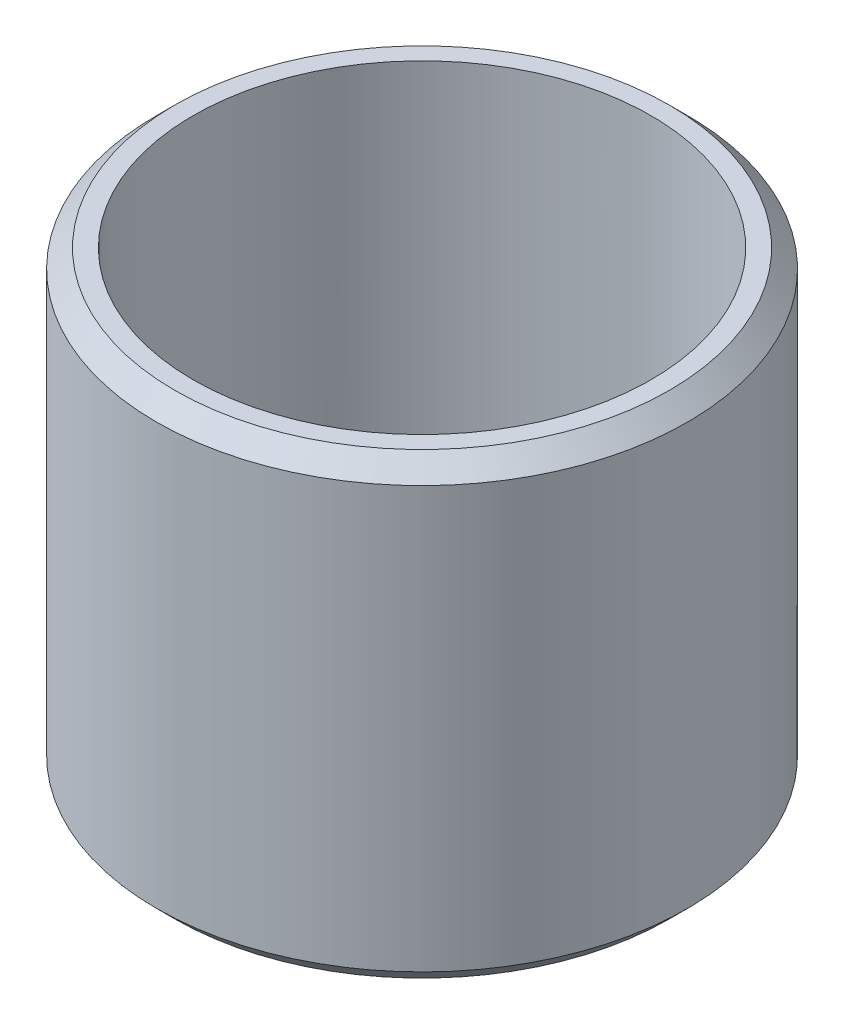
ISO-10303-21;
HEADER;
FILE_DESCRIPTION(('STEP AP214'),'2;1');
FILE_NAME('part.step','',(''),(''),'','','');
FILE_SCHEMA(('AUTOMOTIVE_DESIGN { 1 0 10303 214 1 1 1 1 }'));
ENDSEC;
DATA;
#1=APPLICATION_CONTEXT('core data for automotive mechanical design processes');
#2=APPLICATION_PROTOCOL_DEFINITION('international standard','automotive_design',2000,#1);
#3=PRODUCT_CONTEXT('',#1,'mechanical');
#4=PRODUCT('Part','Part','',(#3));
#5=PRODUCT_RELATED_PRODUCT_CATEGORY('part','',(#4));
#6=PRODUCT_DEFINITION_FORMATION('','',#4);
#7=PRODUCT_DEFINITION_CONTEXT('part definition',#1,'design');
#8=PRODUCT_DEFINITION('design','',#6,#7);
#9=PRODUCT_DEFINITION_SHAPE('','',#8);
#10=(LENGTH_UNIT() NAMED_UNIT(*) SI_UNIT(.MILLI.,.METRE.));
#11=(NAMED_UNIT(*) PLANE_ANGLE_UNIT() SI_UNIT($,.RADIAN.));
#12=(NAMED_UNIT(*) SI_UNIT($,.STERADIAN.) SOLID_ANGLE_UNIT());
#13=UNCERTAINTY_MEASURE_WITH_UNIT(LENGTH_MEASURE(1.E-05),#10,'distance_accuracy_value','');
#14=(GEOMETRIC_REPRESENTATION_CONTEXT(3) GLOBAL_UNCERTAINTY_ASSIGNED_CONTEXT((#13)) GLOBAL_UNIT_ASSIGNED_CONTEXT((#10,
#11,#12)) REPRESENTATION_CONTEXT('',''));
#15=CARTESIAN_POINT('',(0.,0.,0.));
#16=DIRECTION('',(0.,0.,1.));
#17=DIRECTION('',(1.,0.,0.));
#18=AXIS2_PLACEMENT_3D('',#15,#16,#17);
#19=CARTESIAN_POINT('',(0.,0.,0.));
#20=DIRECTION('',(0.,1.,0.));
#21=DIRECTION('',(0.,0.,1.));
#22=AXIS2_PLACEMENT_3D('',#19,#20,#21);
#23=PLANE('',#22);
#24=CARTESIAN_POINT('',(0.,0.,0.));
#25=DIRECTION('',(0.,1.,0.));
#26=DIRECTION('',(0.,0.,1.));
#27=AXIS2_PLACEMENT_3D('',#24,#25,#26);
#28=CIRCLE('',#27,12.1);
#29=CARTESIAN_POINT('',(-12.0187353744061,0.,1.4));
#30=VERTEX_POINT('',#29);
#31=CARTESIAN_POINT('',(-1.4,0.,12.0187353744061));
#32=VERTEX_POINT('',#31);
#33=EDGE_CURVE('E607',#30,#32,#28,.T.);
#34=ORIENTED_EDGE('',*,*,#33,.T.);
#35=DIRECTION('',(0.,0.,1.));
#36=VECTOR('',#35,1.);
#37=CARTESIAN_POINT('',(-1.4,0.,0.));
#38=LINE('',#37,#36);
#39=CARTESIAN_POINT('',(-1.4,0.,11.4));
#40=VERTEX_POINT('',#39);
#41=EDGE_CURVE('E612',#32,#40,#38,.F.);
#42=ORIENTED_EDGE('',*,*,#41,.T.);
#43=CARTESIAN_POINT('',(-0.599999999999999,0.,11.4));
#44=DIRECTION('',(0.,1.,0.));
#45=DIRECTION('',(0.,0.,1.));
#46=AXIS2_PLACEMENT_3D('',#43,#44,#45);
#47=CIRCLE('',#46,0.8);
#48=CARTESIAN_POINT('',(-0.599999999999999,0.,10.6));
#49=VERTEX_POINT('',#48);
#50=EDGE_CURVE('E609',#49,#40,#47,.T.);
#51=ORIENTED_EDGE('',*,*,#50,.F.);
#52=DIRECTION('',(-1.,0.,0.));
#53=VECTOR('',#52,1.);
#54=CARTESIAN_POINT('',(0.,0.,10.6));
#55=LINE('',#54,#53);
#56=CARTESIAN_POINT('',(0.600000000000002,0.,10.6));
#57=VERTEX_POINT('',#56);
#58=EDGE_CURVE('E600',#49,#57,#55,.F.);
#59=ORIENTED_EDGE('',*,*,#58,.T.);
#60=CARTESIAN_POINT('',(0.600000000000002,0.,11.4));
#61=DIRECTION('',(0.,1.,0.));
#62=DIRECTION('',(0.,0.,1.));
#63=AXIS2_PLACEMENT_3D('',#60,#61,#62);
#64=CIRCLE('',#63,0.8);
#65=CARTESIAN_POINT('',(1.4,0.,11.4));
#66=VERTEX_POINT('',#65);
#67=EDGE_CURVE('E597',#66,#57,#64,.T.);
#68=ORIENTED_EDGE('',*,*,#67,.F.);
#69=DIRECTION('',(0.,0.,-1.));
#70=VECTOR('',#69,1.);
#71=CARTESIAN_POINT('',(1.4,0.,0.));
#72=LINE('',#71,#70);
#73=CARTESIAN_POINT('',(1.4,0.,12.0187353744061));
#74=VERTEX_POINT('',#73);
#75=EDGE_CURVE('E590',#66,#74,#72,.F.);
#76=ORIENTED_EDGE('',*,*,#75,.T.);
#77=CARTESIAN_POINT('',(0.,0.,0.));
#78=DIRECTION('',(0.,1.,0.));
#79=DIRECTION('',(0.,0.,1.));
#80=AXIS2_PLACEMENT_3D('',#77,#78,#79);
#81=CIRCLE('',#80,12.1);
#82=CARTESIAN_POINT('',(12.0187353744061,0.,1.4));
#83=VERTEX_POINT('',#82);
#84=EDGE_CURVE('E579',#74,#83,#81,.T.);
#85=ORIENTED_EDGE('',*,*,#84,.T.);
#86=DIRECTION('',(1.,0.,0.));
#87=VECTOR('',#86,1.);
#88=CARTESIAN_POINT('',(0.,0.,1.4));
#89=LINE('',#88,#87);
#90=CARTESIAN_POINT('',(11.4,0.,1.4));
#91=VERTEX_POINT('',#90);
#92=EDGE_CURVE('E571',#83,#91,#89,.F.);
#93=ORIENTED_EDGE('',*,*,#92,.T.);
#94=CARTESIAN_POINT('',(11.4,0.,0.6));
#95=DIRECTION('',(0.,1.,0.));
#96=DIRECTION('',(0.,0.,1.));
#97=AXIS2_PLACEMENT_3D('',#94,#95,#96);
#98=CIRCLE('',#97,0.8);
#99=CARTESIAN_POINT('',(10.6,0.,0.6));
#100=VERTEX_POINT('',#99);
#101=EDGE_CURVE('E568',#100,#91,#98,.T.);
#102=ORIENTED_EDGE('',*,*,#101,.F.);
#103=DIRECTION('',(0.,0.,1.));
#104=VECTOR('',#103,1.);
#105=CARTESIAN_POINT('',(10.6,0.,0.));
#106=LINE('',#105,#104);
#107=CARTESIAN_POINT('',(10.6,0.,-0.6));
#108=VERTEX_POINT('',#107);
#109=EDGE_CURVE('E560',#100,#108,#106,.F.);
#110=ORIENTED_EDGE('',*,*,#109,.T.);
#111=CARTESIAN_POINT('',(11.4,0.,-0.6));
#112=DIRECTION('',(0.,1.,0.));
#113=DIRECTION('',(0.,0.,1.));
#114=AXIS2_PLACEMENT_3D('',#111,#112,#113);
#115=CIRCLE('',#114,0.8);
#116=CARTESIAN_POINT('',(11.4,0.,-1.4));
#117=VERTEX_POINT('',#116);
#118=EDGE_CURVE('E557',#117,#108,#115,.T.);
#119=ORIENTED_EDGE('',*,*,#118,.F.);
#120=DIRECTION('',(-1.,0.,0.));
#121=VECTOR('',#120,1.);
#122=CARTESIAN_POINT('',(0.,0.,-1.4));
#123=LINE('',#122,#121);
#124=CARTESIAN_POINT('',(12.0187353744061,0.,-1.4));
#125=VERTEX_POINT('',#124);
#126=EDGE_CURVE('E562',#117,#125,#123,.F.);
#127=ORIENTED_EDGE('',*,*,#126,.T.);
#128=CARTESIAN_POINT('',(0.,0.,0.));
#129=DIRECTION('',(0.,1.,0.));
#130=DIRECTION('',(0.,0.,1.));
#131=AXIS2_PLACEMENT_3D('',#128,#129,#130);
#132=CIRCLE('',#131,12.1);
#133=CARTESIAN_POINT('',(1.4,0.,-12.0187353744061));
#134=VERTEX_POINT('',#133);
#135=EDGE_CURVE('E564',#125,#134,#132,.T.);
#136=ORIENTED_EDGE('',*,*,#135,.T.);
#137=DIRECTION('',(0.,0.,-1.));
#138=VECTOR('',#137,1.);
#139=CARTESIAN_POINT('',(1.39999999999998,0.,0.));
#140=LINE('',#139,#138);
#141=CARTESIAN_POINT('',(1.4,0.,-11.4));
#142=VERTEX_POINT('',#141);
#143=EDGE_CURVE('E566',#134,#142,#140,.F.);
#144=ORIENTED_EDGE('',*,*,#143,.T.);
#145=CARTESIAN_POINT('',(0.6,0.,-11.4));
#146=DIRECTION('',(0.,1.,0.));
#147=DIRECTION('',(0.,0.,1.));
#148=AXIS2_PLACEMENT_3D('',#145,#146,#147);
#149=CIRCLE('',#148,0.8);
#150=CARTESIAN_POINT('',(0.6,0.,-10.6));
#151=VERTEX_POINT('',#150);
#152=EDGE_CURVE('E574',#151,#142,#149,.T.);
#153=ORIENTED_EDGE('',*,*,#152,.F.);
#154=DIRECTION('',(1.,0.,0.));
#155=VECTOR('',#154,1.);
#156=CARTESIAN_POINT('',(0.,0.,-10.6));
#157=LINE('',#156,#155);
#158=CARTESIAN_POINT('',(-0.600000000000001,0.,-10.6));
#159=VERTEX_POINT('',#158);
#160=EDGE_CURVE('E577',#151,#159,#157,.F.);
#161=ORIENTED_EDGE('',*,*,#160,.T.);
#162=CARTESIAN_POINT('',(-0.600000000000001,0.,-11.4));
#163=DIRECTION('',(0.,1.,0.));
#164=DIRECTION('',(0.,0.,1.));
#165=AXIS2_PLACEMENT_3D('',#162,#163,#164);
#166=CIRCLE('',#165,0.8);
#167=CARTESIAN_POINT('',(-1.4,0.,-11.4));
#168=VERTEX_POINT('',#167);
#169=EDGE_CURVE('E581',#168,#159,#166,.T.);
#170=ORIENTED_EDGE('',*,*,#169,.F.);
#171=DIRECTION('',(0.,0.,1.));
#172=VECTOR('',#171,1.);
#173=CARTESIAN_POINT('',(-1.40000000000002,0.,0.));
#174=LINE('',#173,#172);
#175=CARTESIAN_POINT('',(-1.4,0.,-12.0187353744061));
#176=VERTEX_POINT('',#175);
#177=EDGE_CURVE('E584',#168,#176,#174,.F.);
#178=ORIENTED_EDGE('',*,*,#177,.T.);
#179=CARTESIAN_POINT('',(0.,0.,0.));
#180=DIRECTION('',(0.,1.,0.));
#181=DIRECTION('',(0.,0.,1.));
#182=AXIS2_PLACEMENT_3D('',#179,#180,#181);
#183=CIRCLE('',#182,12.1);
#184=CARTESIAN_POINT('',(-12.0187353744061,0.,-1.4));
#185=VERTEX_POINT('',#184);
#186=EDGE_CURVE('E586',#176,#185,#183,.T.);
#187=ORIENTED_EDGE('',*,*,#186,.T.);
#188=DIRECTION('',(-1.,0.,0.));
#189=VECTOR('',#188,1.);
#190=CARTESIAN_POINT('',(0.,0.,-1.4));
#191=LINE('',#190,#189);
#192=CARTESIAN_POINT('',(-11.4,0.,-1.4));
#193=VERTEX_POINT('',#192);
#194=EDGE_CURVE('E588',#185,#193,#191,.F.);
#195=ORIENTED_EDGE('',*,*,#194,.T.);
#196=CARTESIAN_POINT('',(-11.4,0.,-0.6));
#197=DIRECTION('',(0.,1.,0.));
#198=DIRECTION('',(0.,0.,1.));
#199=AXIS2_PLACEMENT_3D('',#196,#197,#198);
#200=CIRCLE('',#199,0.8);
#201=CARTESIAN_POINT('',(-10.6,0.,-0.6));
#202=VERTEX_POINT('',#201);
#203=EDGE_CURVE('E592',#202,#193,#200,.T.);
#204=ORIENTED_EDGE('',*,*,#203,.F.);
#205=DIRECTION('',(0.,0.,-1.));
#206=VECTOR('',#205,1.);
#207=CARTESIAN_POINT('',(-10.6,0.,0.));
#208=LINE('',#207,#206);
#209=CARTESIAN_POINT('',(-10.6,0.,0.6));
#210=VERTEX_POINT('',#209);
#211=EDGE_CURVE('E595',#202,#210,#208,.F.);
#212=ORIENTED_EDGE('',*,*,#211,.T.);
#213=CARTESIAN_POINT('',(-11.4,0.,0.6));
#214=DIRECTION('',(0.,1.,0.));
#215=DIRECTION('',(0.,0.,1.));
#216=AXIS2_PLACEMENT_3D('',#213,#214,#215);
#217=CIRCLE('',#216,0.8);
#218=CARTESIAN_POINT('',(-11.4,0.,1.4));
#219=VERTEX_POINT('',#218);
#220=EDGE_CURVE('E602',#219,#210,#217,.T.);
#221=ORIENTED_EDGE('',*,*,#220,.F.);
#222=DIRECTION('',(1.,0.,0.));
#223=VECTOR('',#222,1.);
#224=CARTESIAN_POINT('',(0.,0.,1.4));
#225=LINE('',#224,#223);
#226=EDGE_CURVE('E605',#219,#30,#225,.F.);
#227=ORIENTED_EDGE('',*,*,#226,.T.);
#228=EDGE_LOOP('',(#34,#42,#51,#59,#68,#76,#85,#93,#102,#110,#119,#127,#136,#144,#153,#161,#170,
#178,#187,#195,#204,#212,#221,#227));
#229=FACE_BOUND('',#228,.T.);
#230=CARTESIAN_POINT('',(0.,0.,0.));
#231=DIRECTION('',(0.,1.,0.));
#232=DIRECTION('',(0.,0.,1.));
#233=AXIS2_PLACEMENT_3D('',#230,#231,#232);
#234=CIRCLE('',#233,7.16568542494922);
#235=CARTESIAN_POINT('',(0.,0.,7.16568542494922));
#236=VERTEX_POINT('',#235);
#237=EDGE_CURVE('E554',#236,#236,#234,.F.);
#238=ORIENTED_EDGE('',*,*,#237,.T.);
#239=EDGE_LOOP('',(#238));
#240=FACE_BOUND('',#239,.T.);
#241=ADVANCED_FACE('F37',(#229,#240),#23,.T.);
#242=CARTESIAN_POINT('',(0.,20.,0.));
#243=DIRECTION('',(0.,-1.,0.));
#244=DIRECTION('',(0.,0.,-1.));
#245=AXIS2_PLACEMENT_3D('',#242,#243,#244);
#246=CYLINDRICAL_SURFACE('',#245,12.5);
#247=CARTESIAN_POINT('',(0.,20.,0.));
#248=DIRECTION('',(0.,1.,0.));
#249=DIRECTION('',(0.,0.,1.));
#250=AXIS2_PLACEMENT_3D('',#247,#248,#249);
#251=CIRCLE('',#250,12.5);
#252=CARTESIAN_POINT('',(0.,20.,12.5));
#253=VERTEX_POINT('',#252);
#254=EDGE_CURVE('E440',#253,#253,#251,.T.);
#255=ORIENTED_EDGE('',*,*,#254,.T.);
#256=EDGE_LOOP('',(#255));
#257=FACE_BOUND('',#256,.T.);
#258=CARTESIAN_POINT('',(0.,5.,0.));
#259=DIRECTION('',(0.,1.,0.));
#260=DIRECTION('',(0.,0.,1.));
#261=AXIS2_PLACEMENT_3D('',#258,#259,#260);
#262=CIRCLE('',#261,12.5);
#263=CARTESIAN_POINT('',(1.44628099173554,5.,-12.4160489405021));
#264=VERTEX_POINT('',#263);
#265=CARTESIAN_POINT('',(-1.44628099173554,5.,-12.4160489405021));
#266=VERTEX_POINT('',#265);
#267=EDGE_CURVE('E900',#264,#266,#262,.T.);
#268=ORIENTED_EDGE('',*,*,#267,.F.);
#269=DIRECTION('',(0.,-1.,0.));
#270=VECTOR('',#269,1.);
#271=CARTESIAN_POINT('',(1.44628099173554,20.,-12.4160489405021));
#272=LINE('',#271,#270);
#273=CARTESIAN_POINT('',(1.44628099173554,0.400000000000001,-12.4160489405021));
#274=VERTEX_POINT('',#273);
#275=EDGE_CURVE('E640',#264,#274,#272,.T.);
#276=ORIENTED_EDGE('',*,*,#275,.T.);
#277=CARTESIAN_POINT('',(0.,0.400000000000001,0.));
#278=DIRECTION('',(0.,1.,0.));
#279=DIRECTION('',(0.,0.,1.));
#280=AXIS2_PLACEMENT_3D('',#277,#278,#279);
#281=CIRCLE('',#280,12.5);
#282=CARTESIAN_POINT('',(12.4160489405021,0.400000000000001,-1.44628099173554));
#283=VERTEX_POINT('',#282);
#284=EDGE_CURVE('E638',#274,#283,#281,.F.);
#285=ORIENTED_EDGE('',*,*,#284,.T.);
#286=DIRECTION('',(0.,-1.,0.));
#287=VECTOR('',#286,1.);
#288=CARTESIAN_POINT('',(12.4160489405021,20.,-1.44628099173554));
#289=LINE('',#288,#287);
#290=CARTESIAN_POINT('',(12.4160489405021,5.,-1.44628099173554));
#291=VERTEX_POINT('',#290);
#292=EDGE_CURVE('E635',#283,#291,#289,.F.);
#293=ORIENTED_EDGE('',*,*,#292,.T.);
#294=CARTESIAN_POINT('',(0.,5.,0.));
#295=DIRECTION('',(0.,1.,0.));
#296=DIRECTION('',(0.,0.,1.));
#297=AXIS2_PLACEMENT_3D('',#294,#295,#296);
#298=CIRCLE('',#297,12.5);
#299=CARTESIAN_POINT('',(12.4160489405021,5.,1.44628099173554));
#300=VERTEX_POINT('',#299);
#301=EDGE_CURVE('E866',#300,#291,#298,.T.);
#302=ORIENTED_EDGE('',*,*,#301,.F.);
#303=DIRECTION('',(0.,-1.,0.));
#304=VECTOR('',#303,1.);
#305=CARTESIAN_POINT('',(12.4160489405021,20.,1.44628099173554));
#306=LINE('',#305,#304);
#307=CARTESIAN_POINT('',(12.4160489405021,0.400000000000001,1.44628099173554));
#308=VERTEX_POINT('',#307);
#309=EDGE_CURVE('E633',#300,#308,#306,.T.);
#310=ORIENTED_EDGE('',*,*,#309,.T.);
#311=CARTESIAN_POINT('',(0.,0.400000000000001,0.));
#312=DIRECTION('',(0.,1.,0.));
#313=DIRECTION('',(0.,0.,1.));
#314=AXIS2_PLACEMENT_3D('',#311,#312,#313);
#315=CIRCLE('',#314,12.5);
#316=CARTESIAN_POINT('',(1.44628099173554,0.400000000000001,12.4160489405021));
#317=VERTEX_POINT('',#316);
#318=EDGE_CURVE('E631',#308,#317,#315,.F.);
#319=ORIENTED_EDGE('',*,*,#318,.T.);
#320=DIRECTION('',(0.,-1.,0.));
#321=VECTOR('',#320,1.);
#322=CARTESIAN_POINT('',(1.44628099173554,20.,12.4160489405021));
#323=LINE('',#322,#321);
#324=CARTESIAN_POINT('',(1.44628099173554,5.,12.4160489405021));
#325=VERTEX_POINT('',#324);
#326=EDGE_CURVE('E628',#317,#325,#323,.F.);
#327=ORIENTED_EDGE('',*,*,#326,.T.);
#328=CARTESIAN_POINT('',(0.,5.,0.));
#329=DIRECTION('',(0.,1.,0.));
#330=DIRECTION('',(0.,0.,1.));
#331=AXIS2_PLACEMENT_3D('',#328,#329,#330);
#332=CIRCLE('',#331,12.5);
#333=CARTESIAN_POINT('',(-1.44628099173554,5.,12.4160489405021));
#334=VERTEX_POINT('',#333);
#335=EDGE_CURVE('E889',#334,#325,#332,.T.);
#336=ORIENTED_EDGE('',*,*,#335,.F.);
#337=DIRECTION('',(0.,-1.,0.));
#338=VECTOR('',#337,1.);
#339=CARTESIAN_POINT('',(-1.44628099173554,20.,12.4160489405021));
#340=LINE('',#339,#338);
#341=CARTESIAN_POINT('',(-1.44628099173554,0.400000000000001,12.4160489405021));
#342=VERTEX_POINT('',#341);
#343=EDGE_CURVE('E626',#334,#342,#340,.T.);
#344=ORIENTED_EDGE('',*,*,#343,.T.);
#345=CARTESIAN_POINT('',(0.,0.400000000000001,0.));
#346=DIRECTION('',(0.,1.,0.));
#347=DIRECTION('',(0.,0.,1.));
#348=AXIS2_PLACEMENT_3D('',#345,#346,#347);
#349=CIRCLE('',#348,12.5);
#350=CARTESIAN_POINT('',(-12.4160489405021,0.400000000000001,1.44628099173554));
#351=VERTEX_POINT('',#350);
#352=EDGE_CURVE('E624',#342,#351,#349,.F.);
#353=ORIENTED_EDGE('',*,*,#352,.T.);
#354=DIRECTION('',(0.,-1.,0.));
#355=VECTOR('',#354,1.);
#356=CARTESIAN_POINT('',(-12.4160489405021,20.,1.44628099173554));
#357=LINE('',#356,#355);
#358=CARTESIAN_POINT('',(-12.4160489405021,5.,1.44628099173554));
#359=VERTEX_POINT('',#358);
#360=EDGE_CURVE('E621',#351,#359,#357,.F.);
#361=ORIENTED_EDGE('',*,*,#360,.T.);
#362=CARTESIAN_POINT('',(0.,5.,0.));
#363=DIRECTION('',(0.,1.,0.));
#364=DIRECTION('',(0.,0.,1.));
#365=AXIS2_PLACEMENT_3D('',#362,#363,#364);
#366=CIRCLE('',#365,12.5);
#367=CARTESIAN_POINT('',(-12.4160489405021,5.,-1.44628099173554));
#368=VERTEX_POINT('',#367);
#369=EDGE_CURVE('E881',#368,#359,#366,.T.);
#370=ORIENTED_EDGE('',*,*,#369,.F.);
#371=DIRECTION('',(0.,-1.,0.));
#372=VECTOR('',#371,1.);
#373=CARTESIAN_POINT('',(-12.4160489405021,20.,-1.44628099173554));
#374=LINE('',#373,#372);
#375=CARTESIAN_POINT('',(-12.4160489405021,0.400000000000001,-1.44628099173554));
#376=VERTEX_POINT('',#375);
#377=EDGE_CURVE('E614',#368,#376,#374,.T.);
#378=ORIENTED_EDGE('',*,*,#377,.T.);
#379=CARTESIAN_POINT('',(0.,0.400000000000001,0.));
#380=DIRECTION('',(0.,1.,0.));
#381=DIRECTION('',(0.,0.,1.));
#382=AXIS2_PLACEMENT_3D('',#379,#380,#381);
#383=CIRCLE('',#382,12.5);
#384=CARTESIAN_POINT('',(-1.44628099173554,0.400000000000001,-12.4160489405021));
#385=VERTEX_POINT('',#384);
#386=EDGE_CURVE('E616',#376,#385,#383,.F.);
#387=ORIENTED_EDGE('',*,*,#386,.T.);
#388=DIRECTION('',(0.,-1.,0.));
#389=VECTOR('',#388,1.);
#390=CARTESIAN_POINT('',(-1.44628099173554,20.,-12.4160489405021));
#391=LINE('',#390,#389);
#392=EDGE_CURVE('E618',#385,#266,#391,.F.);
#393=ORIENTED_EDGE('',*,*,#392,.T.);
#394=EDGE_LOOP('',(#268,#276,#285,#293,#302,#310,#319,#327,#336,#344,#353,#361,#370,#378,#387,#393));
#395=FACE_BOUND('',#394,.T.);
#396=ADVANCED_FACE('F932',(#257,#395),#246,.F.);
#397=CARTESIAN_POINT('',(0.,-1.,0.));
#398=DIRECTION('',(0.,-1.,0.));
#399=DIRECTION('',(0.,0.,-1.));
#400=AXIS2_PLACEMENT_3D('',#397,#398,#399);
#401=PLANE('',#400);
#402=DIRECTION('',(0.866025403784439,0.,-0.5));
#403=VECTOR('',#402,1.);
#404=CARTESIAN_POINT('',(-4.2,-1.,-2.42487113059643));
#405=LINE('',#404,#403);
#406=CARTESIAN_POINT('',(-4.2,-1.,-2.42487113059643));
#407=VERTEX_POINT('',#406);
#408=CARTESIAN_POINT('',(-2.1,-1.,-3.63730669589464));
#409=VERTEX_POINT('',#408);
#410=EDGE_CURVE('E428',#407,#409,#405,.T.);
#411=ORIENTED_EDGE('',*,*,#410,.T.);
#412=CARTESIAN_POINT('',(0.,-1.,0.));
#413=DIRECTION('',(0.,-1.,0.));
#414=DIRECTION('',(0.,0.,-1.));
#415=AXIS2_PLACEMENT_3D('',#412,#413,#414);
#416=CIRCLE('',#415,4.2);
#417=CARTESIAN_POINT('',(-4.2,-1.,0.));
#418=VERTEX_POINT('',#417);
#419=EDGE_CURVE('E518',#409,#418,#416,.F.);
#420=ORIENTED_EDGE('',*,*,#419,.T.);
#421=DIRECTION('',(0.,0.,-1.));
#422=VECTOR('',#421,1.);
#423=CARTESIAN_POINT('',(-4.2,-1.,2.42487113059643));
#424=LINE('',#423,#422);
#425=EDGE_CURVE('E420',#418,#407,#424,.T.);
#426=ORIENTED_EDGE('',*,*,#425,.T.);
#427=EDGE_LOOP('',(#411,#420,#426));
#428=FACE_BOUND('',#427,.T.);
#429=ADVANCED_FACE('F938',(#428),#401,.T.);
#430=CARTESIAN_POINT('',(-4.2,-1.,2.42487113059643));
#431=VERTEX_POINT('',#430);
#432=EDGE_CURVE('E422',#431,#418,#424,.T.);
#433=ORIENTED_EDGE('',*,*,#432,.T.);
#434=CARTESIAN_POINT('',(0.,-1.,0.));
#435=DIRECTION('',(0.,-1.,0.));
#436=DIRECTION('',(0.,0.,-1.));
#437=AXIS2_PLACEMENT_3D('',#434,#435,#436);
#438=CIRCLE('',#437,4.2);
#439=CARTESIAN_POINT('',(-2.1,-1.,3.63730669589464));
#440=VERTEX_POINT('',#439);
#441=EDGE_CURVE('E516',#418,#440,#438,.F.);
#442=ORIENTED_EDGE('',*,*,#441,.T.);
#443=DIRECTION('',(-0.866025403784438,0.,-0.5));
#444=VECTOR('',#443,1.);
#445=CARTESIAN_POINT('',(0.,-1.,4.84974226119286));
#446=LINE('',#445,#444);
#447=EDGE_CURVE('E419',#440,#431,#446,.T.);
#448=ORIENTED_EDGE('',*,*,#447,.T.);
#449=EDGE_LOOP('',(#433,#442,#448));
#450=FACE_BOUND('',#449,.T.);
#451=ADVANCED_FACE('F1365',(#450),#401,.T.);
#452=CARTESIAN_POINT('',(0.,-1.,4.84974226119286));
#453=VERTEX_POINT('',#452);
#454=EDGE_CURVE('E396',#453,#440,#446,.T.);
#455=ORIENTED_EDGE('',*,*,#454,.T.);
#456=CARTESIAN_POINT('',(0.,-1.,0.));
#457=DIRECTION('',(0.,-1.,0.));
#458=DIRECTION('',(0.,0.,-1.));
#459=AXIS2_PLACEMENT_3D('',#456,#457,#458);
#460=CIRCLE('',#459,4.2);
#461=CARTESIAN_POINT('',(2.1,-1.,3.63730669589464));
#462=VERTEX_POINT('',#461);
#463=EDGE_CURVE('E398',#440,#462,#460,.F.);
#464=ORIENTED_EDGE('',*,*,#463,.T.);
#465=DIRECTION('',(-0.866025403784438,0.,0.5));
#466=VECTOR('',#465,1.);
#467=CARTESIAN_POINT('',(4.2,-1.,2.42487113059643));
#468=LINE('',#467,#466);
#469=EDGE_CURVE('E392',#462,#453,#468,.T.);
#470=ORIENTED_EDGE('',*,*,#469,.T.);
#471=EDGE_LOOP('',(#455,#464,#470));
#472=FACE_BOUND('',#471,.T.);
#473=ADVANCED_FACE('F394',(#472),#401,.T.);
#474=CARTESIAN_POINT('',(4.2,-1.,2.42487113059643));
#475=VERTEX_POINT('',#474);
#476=EDGE_CURVE('E402',#475,#462,#468,.T.);
#477=ORIENTED_EDGE('',*,*,#476,.T.);
#478=CARTESIAN_POINT('',(0.,-1.,0.));
#479=DIRECTION('',(0.,-1.,0.));
#480=DIRECTION('',(0.,0.,-1.));
#481=AXIS2_PLACEMENT_3D('',#478,#479,#480);
#482=CIRCLE('',#481,4.2);
#483=CARTESIAN_POINT('',(4.2,-1.,0.));
#484=VERTEX_POINT('',#483);
#485=EDGE_CURVE('E513',#462,#484,#482,.F.);
#486=ORIENTED_EDGE('',*,*,#485,.T.);
#487=DIRECTION('',(0.,0.,1.));
#488=VECTOR('',#487,1.);
#489=CARTESIAN_POINT('',(4.2,-1.,-2.42487113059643));
#490=LINE('',#489,#488);
#491=EDGE_CURVE('E435',#484,#475,#490,.T.);
#492=ORIENTED_EDGE('',*,*,#491,.T.);
#493=EDGE_LOOP('',(#477,#486,#492));
#494=FACE_BOUND('',#493,.T.);
#495=ADVANCED_FACE('F1383',(#494),#401,.T.);
#496=CARTESIAN_POINT('',(4.2,-1.,-2.42487113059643));
#497=VERTEX_POINT('',#496);
#498=EDGE_CURVE('E414',#497,#484,#490,.T.);
#499=ORIENTED_EDGE('',*,*,#498,.T.);
#500=CARTESIAN_POINT('',(0.,-1.,0.));
#501=DIRECTION('',(0.,-1.,0.));
#502=DIRECTION('',(0.,0.,-1.));
#503=AXIS2_PLACEMENT_3D('',#500,#501,#502);
#504=CIRCLE('',#503,4.2);
#505=CARTESIAN_POINT('',(2.1,-1.,-3.63730669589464));
#506=VERTEX_POINT('',#505);
#507=EDGE_CURVE('E511',#484,#506,#504,.F.);
#508=ORIENTED_EDGE('',*,*,#507,.T.);
#509=DIRECTION('',(0.866025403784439,0.,0.5));
#510=VECTOR('',#509,1.);
#511=CARTESIAN_POINT('',(0.,-1.,-4.84974226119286));
#512=LINE('',#511,#510);
#513=EDGE_CURVE('E431',#506,#497,#512,.T.);
#514=ORIENTED_EDGE('',*,*,#513,.T.);
#515=EDGE_LOOP('',(#499,#508,#514));
#516=FACE_BOUND('',#515,.T.);
#517=ADVANCED_FACE('F949',(#516),#401,.T.);
#518=CARTESIAN_POINT('',(0.,-5.,0.));
#519=DIRECTION('',(0.,1.,0.));
#520=DIRECTION('',(0.,0.,1.));
#521=AXIS2_PLACEMENT_3D('',#518,#519,#520);
#522=CYLINDRICAL_SURFACE('',#521,2.7);
#523=CARTESIAN_POINT('',(0.,0.500000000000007,0.));
#524=DIRECTION('',(0.,-1.,0.));
#525=DIRECTION('',(0.,0.,-1.));
#526=AXIS2_PLACEMENT_3D('',#523,#524,#525);
#527=CIRCLE('',#526,2.7);
#528=CARTESIAN_POINT('',(0.,0.500000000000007,-2.7));
#529=VERTEX_POINT('',#528);
#530=EDGE_CURVE('E521',#529,#529,#527,.T.);
#531=ORIENTED_EDGE('',*,*,#530,.T.);
#532=EDGE_LOOP('',(#531));
#533=FACE_BOUND('',#532,.T.);
#534=CARTESIAN_POINT('',(0.,3.,0.));
#535=DIRECTION('',(0.,1.,0.));
#536=DIRECTION('',(0.,0.,1.));
#537=AXIS2_PLACEMENT_3D('',#534,#535,#536);
#538=CIRCLE('',#537,2.7);
#539=CARTESIAN_POINT('',(0.,3.,2.7));
#540=VERTEX_POINT('',#539);
#541=EDGE_CURVE('E509',#540,#540,#538,.T.);
#542=ORIENTED_EDGE('',*,*,#541,.T.);
#543=EDGE_LOOP('',(#542));
#544=FACE_BOUND('',#543,.T.);
#545=ADVANCED_FACE('F945',(#533,#544),#522,.F.);
#546=CARTESIAN_POINT('',(0.,20.,0.));
#547=DIRECTION('',(0.,-1.,0.));
#548=DIRECTION('',(0.,0.,-1.));
#549=AXIS2_PLACEMENT_3D('',#546,#547,#548);
#550=CYLINDRICAL_SURFACE('',#549,14.5);
#551=CARTESIAN_POINT('',(0.,19.,0.));
#552=DIRECTION('',(0.,1.,0.));
#553=DIRECTION('',(0.,0.,1.));
#554=AXIS2_PLACEMENT_3D('',#551,#552,#553);
#555=CIRCLE('',#554,14.5);
#556=CARTESIAN_POINT('',(0.,19.,14.5));
#557=VERTEX_POINT('',#556);
#558=EDGE_CURVE('E463',#557,#557,#555,.F.);
#559=ORIENTED_EDGE('',*,*,#558,.T.);
#560=EDGE_LOOP('',(#559));
#561=FACE_BOUND('',#560,.T.);
#562=CARTESIAN_POINT('',(0.,-4.,0.));
#563=DIRECTION('',(0.,1.,0.));
#564=DIRECTION('',(0.,0.,1.));
#565=AXIS2_PLACEMENT_3D('',#562,#563,#564);
#566=CIRCLE('',#565,14.5);
#567=CARTESIAN_POINT('',(0.,-4.,14.5));
#568=VERTEX_POINT('',#567);
#569=EDGE_CURVE('E454',#568,#568,#566,.T.);
#570=ORIENTED_EDGE('',*,*,#569,.T.);
#571=EDGE_LOOP('',(#570));
#572=FACE_BOUND('',#571,.T.);
#573=ADVANCED_FACE('F948',(#561,#572),#550,.T.);
#574=CARTESIAN_POINT('',(0.,20.,0.));
#575=DIRECTION('',(0.,1.,0.));
#576=DIRECTION('',(0.,0.,1.));
#577=AXIS2_PLACEMENT_3D('',#574,#575,#576);
#578=PLANE('',#577);
#579=CARTESIAN_POINT('',(0.,20.,0.));
#580=DIRECTION('',(0.,1.,0.));
#581=DIRECTION('',(0.,0.,1.));
#582=AXIS2_PLACEMENT_3D('',#579,#580,#581);
#583=CIRCLE('',#582,13.5);
#584=CARTESIAN_POINT('',(0.,20.,13.5));
#585=VERTEX_POINT('',#584);
#586=EDGE_CURVE('E460',#585,#585,#583,.T.);
#587=ORIENTED_EDGE('',*,*,#586,.T.);
#588=EDGE_LOOP('',(#587));
#589=FACE_BOUND('',#588,.T.);
#590=ORIENTED_EDGE('',*,*,#254,.F.);
#591=EDGE_LOOP('',(#590));
#592=FACE_BOUND('',#591,.T.);
#593=ADVANCED_FACE('F951',(#589,#592),#578,.T.);
#594=CARTESIAN_POINT('',(0.,-5.,0.));
#595=DIRECTION('',(0.,1.,0.));
#596=DIRECTION('',(0.,0.,1.));
#597=AXIS2_PLACEMENT_3D('',#594,#595,#596);
#598=PLANE('',#597);
#599=DIRECTION('',(-0.866025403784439,0.,0.5));
#600=VECTOR('',#599,1.);
#601=CARTESIAN_POINT('',(-2.3,-5.,-3.98371685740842));
#602=LINE('',#601,#600);
#603=CARTESIAN_POINT('',(0.,-5.,-5.31162247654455));
#604=VERTEX_POINT('',#603);
#605=CARTESIAN_POINT('',(-4.6,-5.,-2.65581123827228));
#606=VERTEX_POINT('',#605);
#607=EDGE_CURVE('E477',#604,#606,#602,.T.);
#608=ORIENTED_EDGE('',*,*,#607,.T.);
#609=DIRECTION('',(0.,0.,1.));
#610=VECTOR('',#609,1.);
#611=CARTESIAN_POINT('',(-4.6,-5.,0.));
#612=LINE('',#611,#610);
#613=CARTESIAN_POINT('',(-4.6,-5.,2.65581123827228));
#614=VERTEX_POINT('',#613);
#615=EDGE_CURVE('E479',#606,#614,#612,.T.);
#616=ORIENTED_EDGE('',*,*,#615,.T.);
#617=DIRECTION('',(0.866025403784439,0.,0.5));
#618=VECTOR('',#617,1.);
#619=CARTESIAN_POINT('',(-2.3,-5.,3.98371685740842));
#620=LINE('',#619,#618);
#621=CARTESIAN_POINT('',(0.,-5.,5.31162247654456));
#622=VERTEX_POINT('',#621);
#623=EDGE_CURVE('E469',#614,#622,#620,.T.);
#624=ORIENTED_EDGE('',*,*,#623,.T.);
#625=DIRECTION('',(0.866025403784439,0.,-0.5));
#626=VECTOR('',#625,1.);
#627=CARTESIAN_POINT('',(2.3,-5.,3.98371685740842));
#628=LINE('',#627,#626);
#629=CARTESIAN_POINT('',(4.6,-5.,2.65581123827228));
#630=VERTEX_POINT('',#629);
#631=EDGE_CURVE('E471',#622,#630,#628,.T.);
#632=ORIENTED_EDGE('',*,*,#631,.T.);
#633=DIRECTION('',(0.,0.,-1.));
#634=VECTOR('',#633,1.);
#635=CARTESIAN_POINT('',(4.6,-5.,0.));
#636=LINE('',#635,#634);
#637=CARTESIAN_POINT('',(4.6,-5.,-2.65581123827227));
#638=VERTEX_POINT('',#637);
#639=EDGE_CURVE('E473',#630,#638,#636,.T.);
#640=ORIENTED_EDGE('',*,*,#639,.T.);
#641=DIRECTION('',(-0.866025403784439,0.,-0.5));
#642=VECTOR('',#641,1.);
#643=CARTESIAN_POINT('',(2.3,-5.,-3.98371685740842));
#644=LINE('',#643,#642);
#645=EDGE_CURVE('E475',#638,#604,#644,.T.);
#646=ORIENTED_EDGE('',*,*,#645,.T.);
#647=EDGE_LOOP('',(#608,#616,#624,#632,#640,#646));
#648=FACE_BOUND('',#647,.T.);
#649=CARTESIAN_POINT('',(0.,-5.,0.));
#650=DIRECTION('',(0.,1.,0.));
#651=DIRECTION('',(0.,0.,1.));
#652=AXIS2_PLACEMENT_3D('',#649,#650,#651);
#653=CIRCLE('',#652,13.5);
#654=CARTESIAN_POINT('',(0.,-5.,13.5));
#655=VERTEX_POINT('',#654);
#656=EDGE_CURVE('E457',#655,#655,#653,.F.);
#657=ORIENTED_EDGE('',*,*,#656,.T.);
#658=EDGE_LOOP('',(#657));
#659=FACE_BOUND('',#658,.T.);
#660=ADVANCED_FACE('F943',(#648,#659),#598,.F.);
#661=CARTESIAN_POINT('',(0.,-1.,-4.84974226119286));
#662=VERTEX_POINT('',#661);
#663=EDGE_CURVE('E432',#662,#506,#512,.T.);
#664=ORIENTED_EDGE('',*,*,#663,.T.);
#665=CARTESIAN_POINT('',(0.,-1.,0.));
#666=DIRECTION('',(0.,-1.,0.));
#667=DIRECTION('',(0.,0.,-1.));
#668=AXIS2_PLACEMENT_3D('',#665,#666,#667);
#669=CIRCLE('',#668,4.2);
#670=EDGE_CURVE('E491',#506,#409,#669,.F.);
#671=ORIENTED_EDGE('',*,*,#670,.T.);
#672=EDGE_CURVE('E427',#409,#662,#405,.T.);
#673=ORIENTED_EDGE('',*,*,#672,.T.);
#674=EDGE_LOOP('',(#664,#671,#673));
#675=FACE_BOUND('',#674,.T.);
#676=ADVANCED_FACE('F1209',(#675),#401,.T.);
#677=CARTESIAN_POINT('',(4.2,-1.,2.42487113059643));
#678=DIRECTION('',(0.5,0.,0.866025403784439));
#679=DIRECTION('',(0.866025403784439,0.,-0.5));
#680=AXIS2_PLACEMENT_3D('',#677,#678,#679);
#681=PLANE('',#680);
#682=DIRECTION('',(0.,-1.,0.));
#683=VECTOR('',#682,1.);
#684=CARTESIAN_POINT('',(4.2,-1.,2.42487113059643));
#685=LINE('',#684,#683);
#686=CARTESIAN_POINT('',(4.2,-4.60000000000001,2.42487113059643));
#687=VERTEX_POINT('',#686);
#688=EDGE_CURVE('E438',#475,#687,#685,.T.);
#689=ORIENTED_EDGE('',*,*,#688,.T.);
#690=DIRECTION('',(-0.866025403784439,0.,0.5));
#691=VECTOR('',#690,1.);
#692=CARTESIAN_POINT('',(4.2,-4.60000000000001,2.42487113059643));
#693=LINE('',#692,#691);
#694=CARTESIAN_POINT('',(0.,-4.60000000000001,4.84974226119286));
#695=VERTEX_POINT('',#694);
#696=EDGE_CURVE('E410',#687,#695,#693,.T.);
#697=ORIENTED_EDGE('',*,*,#696,.T.);
#698=DIRECTION('',(0.,-1.,0.));
#699=VECTOR('',#698,1.);
#700=CARTESIAN_POINT('',(0.,-1.,4.84974226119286));
#701=LINE('',#700,#699);
#702=EDGE_CURVE('E406',#453,#695,#701,.T.);
#703=ORIENTED_EDGE('',*,*,#702,.F.);
#704=ORIENTED_EDGE('',*,*,#469,.F.);
#705=ORIENTED_EDGE('',*,*,#476,.F.);
#706=EDGE_LOOP('',(#689,#697,#703,#704,#705));
#707=FACE_BOUND('',#706,.T.);
#708=ADVANCED_FACE('F408',(#707),#681,.F.);
#709=CARTESIAN_POINT('',(4.2,-1.,-2.42487113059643));
#710=DIRECTION('',(1.,0.,0.));
#711=DIRECTION('',(0.,0.,-1.));
#712=AXIS2_PLACEMENT_3D('',#709,#710,#711);
#713=PLANE('',#712);
#714=DIRECTION('',(0.,-1.,0.));
#715=VECTOR('',#714,1.);
#716=CARTESIAN_POINT('',(4.2,-1.,-2.42487113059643));
#717=LINE('',#716,#715);
#718=CARTESIAN_POINT('',(4.2,-4.60000000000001,-2.42487113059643));
#719=VERTEX_POINT('',#718);
#720=EDGE_CURVE('E441',#497,#719,#717,.T.);
#721=ORIENTED_EDGE('',*,*,#720,.T.);
#722=DIRECTION('',(0.,0.,1.));
#723=VECTOR('',#722,1.);
#724=CARTESIAN_POINT('',(4.2,-4.60000000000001,-2.42487113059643));
#725=LINE('',#724,#723);
#726=EDGE_CURVE('E486',#719,#687,#725,.T.);
#727=ORIENTED_EDGE('',*,*,#726,.T.);
#728=ORIENTED_EDGE('',*,*,#688,.F.);
#729=ORIENTED_EDGE('',*,*,#491,.F.);
#730=ORIENTED_EDGE('',*,*,#498,.F.);
#731=EDGE_LOOP('',(#721,#727,#728,#729,#730));
#732=FACE_BOUND('',#731,.T.);
#733=ADVANCED_FACE('F1213',(#732),#713,.F.);
#734=CARTESIAN_POINT('',(0.,-1.,-4.84974226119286));
#735=DIRECTION('',(0.5,0.,-0.866025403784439));
#736=DIRECTION('',(-0.866025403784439,0.,-0.5));
#737=AXIS2_PLACEMENT_3D('',#734,#735,#736);
#738=PLANE('',#737);
#739=DIRECTION('',(0.,-1.,0.));
#740=VECTOR('',#739,1.);
#741=CARTESIAN_POINT('',(0.,-1.,-4.84974226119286));
#742=LINE('',#741,#740);
#743=CARTESIAN_POINT('',(0.,-4.60000000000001,-4.84974226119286));
#744=VERTEX_POINT('',#743);
#745=EDGE_CURVE('E444',#662,#744,#742,.T.);
#746=ORIENTED_EDGE('',*,*,#745,.T.);
#747=DIRECTION('',(0.866025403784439,0.,0.5));
#748=VECTOR('',#747,1.);
#749=CARTESIAN_POINT('',(0.,-4.60000000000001,-4.84974226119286));
#750=LINE('',#749,#748);
#751=EDGE_CURVE('E484',#744,#719,#750,.T.);
#752=ORIENTED_EDGE('',*,*,#751,.T.);
#753=ORIENTED_EDGE('',*,*,#720,.F.);
#754=ORIENTED_EDGE('',*,*,#513,.F.);
#755=ORIENTED_EDGE('',*,*,#663,.F.);
#756=EDGE_LOOP('',(#746,#752,#753,#754,#755));
#757=FACE_BOUND('',#756,.T.);
#758=ADVANCED_FACE('F1216',(#757),#738,.F.);
#759=CARTESIAN_POINT('',(-4.2,-1.,-2.42487113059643));
#760=DIRECTION('',(-0.5,0.,-0.866025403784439));
#761=DIRECTION('',(-0.866025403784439,0.,0.5));
#762=AXIS2_PLACEMENT_3D('',#759,#760,#761);
#763=PLANE('',#762);
#764=DIRECTION('',(0.,-1.,0.));
#765=VECTOR('',#764,1.);
#766=CARTESIAN_POINT('',(-4.2,-1.,-2.42487113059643));
#767=LINE('',#766,#765);
#768=CARTESIAN_POINT('',(-4.2,-4.60000000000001,-2.42487113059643));
#769=VERTEX_POINT('',#768);
#770=EDGE_CURVE('E447',#407,#769,#767,.T.);
#771=ORIENTED_EDGE('',*,*,#770,.T.);
#772=DIRECTION('',(0.866025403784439,0.,-0.5));
#773=VECTOR('',#772,1.);
#774=CARTESIAN_POINT('',(-4.2,-4.60000000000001,-2.42487113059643));
#775=LINE('',#774,#773);
#776=EDGE_CURVE('E482',#769,#744,#775,.T.);
#777=ORIENTED_EDGE('',*,*,#776,.T.);
#778=ORIENTED_EDGE('',*,*,#745,.F.);
#779=ORIENTED_EDGE('',*,*,#672,.F.);
#780=ORIENTED_EDGE('',*,*,#410,.F.);
#781=EDGE_LOOP('',(#771,#777,#778,#779,#780));
#782=FACE_BOUND('',#781,.T.);
#783=ADVANCED_FACE('F1220',(#782),#763,.F.);
#784=CARTESIAN_POINT('',(-4.2,-1.,2.42487113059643));
#785=DIRECTION('',(-1.,0.,0.));
#786=DIRECTION('',(0.,0.,1.));
#787=AXIS2_PLACEMENT_3D('',#784,#785,#786);
#788=PLANE('',#787);
#789=DIRECTION('',(0.,-1.,0.));
#790=VECTOR('',#789,1.);
#791=CARTESIAN_POINT('',(-4.2,-1.,2.42487113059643));
#792=LINE('',#791,#790);
#793=CARTESIAN_POINT('',(-4.2,-4.60000000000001,2.42487113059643));
#794=VERTEX_POINT('',#793);
#795=EDGE_CURVE('E413',#431,#794,#792,.T.);
#796=ORIENTED_EDGE('',*,*,#795,.T.);
#797=DIRECTION('',(0.,0.,-1.));
#798=VECTOR('',#797,1.);
#799=CARTESIAN_POINT('',(-4.2,-4.60000000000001,2.42487113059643));
#800=LINE('',#799,#798);
#801=EDGE_CURVE('E466',#794,#769,#800,.T.);
#802=ORIENTED_EDGE('',*,*,#801,.T.);
#803=ORIENTED_EDGE('',*,*,#770,.F.);
#804=ORIENTED_EDGE('',*,*,#425,.F.);
#805=ORIENTED_EDGE('',*,*,#432,.F.);
#806=EDGE_LOOP('',(#796,#802,#803,#804,#805));
#807=FACE_BOUND('',#806,.T.);
#808=ADVANCED_FACE('F1224',(#807),#788,.F.);
#809=CARTESIAN_POINT('',(0.,-1.,4.84974226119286));
#810=DIRECTION('',(-0.5,0.,0.866025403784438));
#811=DIRECTION('',(0.866025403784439,0.,0.5));
#812=AXIS2_PLACEMENT_3D('',#809,#810,#811);
#813=PLANE('',#812);
#814=ORIENTED_EDGE('',*,*,#702,.T.);
#815=DIRECTION('',(-0.866025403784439,0.,-0.5));
#816=VECTOR('',#815,1.);
#817=CARTESIAN_POINT('',(0.,-4.60000000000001,4.84974226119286));
#818=LINE('',#817,#816);
#819=EDGE_CURVE('E489',#695,#794,#818,.T.);
#820=ORIENTED_EDGE('',*,*,#819,.T.);
#821=ORIENTED_EDGE('',*,*,#795,.F.);
#822=ORIENTED_EDGE('',*,*,#447,.F.);
#823=ORIENTED_EDGE('',*,*,#454,.F.);
#824=EDGE_LOOP('',(#814,#820,#821,#822,#823));
#825=FACE_BOUND('',#824,.T.);
#826=ADVANCED_FACE('F417',(#825),#813,.F.);
#827=CARTESIAN_POINT('',(0.,3.,0.));
#828=DIRECTION('',(0.,1.,0.));
#829=DIRECTION('',(0.,0.,1.));
#830=AXIS2_PLACEMENT_3D('',#827,#828,#829);
#831=PLANE('',#830);
#832=CARTESIAN_POINT('',(0.,3.,0.));
#833=DIRECTION('',(0.,1.,0.));
#834=DIRECTION('',(0.,0.,1.));
#835=AXIS2_PLACEMENT_3D('',#832,#833,#834);
#836=CIRCLE('',#835,4.);
#837=CARTESIAN_POINT('',(0.,3.,4.));
#838=VERTEX_POINT('',#837);
#839=EDGE_CURVE('E403',#838,#838,#836,.T.);
#840=ORIENTED_EDGE('',*,*,#839,.T.);
#841=EDGE_LOOP('',(#840));
#842=FACE_BOUND('',#841,.T.);
#843=ORIENTED_EDGE('',*,*,#541,.F.);
#844=EDGE_LOOP('',(#843));
#845=FACE_BOUND('',#844,.T.);
#846=ADVANCED_FACE('F914',(#842,#845),#831,.T.);
#847=CARTESIAN_POINT('',(0.,3.00000000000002,0.));
#848=DIRECTION('',(0.,-1.,0.));
#849=DIRECTION('',(0.,0.,-1.));
#850=AXIS2_PLACEMENT_3D('',#847,#848,#849);
#851=CONICAL_SURFACE('',#850,4.,0.785398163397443);
#852=CARTESIAN_POINT('',(0.,0.117157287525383,0.));
#853=DIRECTION('',(0.,1.,0.));
#854=DIRECTION('',(0.,0.,1.));
#855=AXIS2_PLACEMENT_3D('',#852,#853,#854);
#856=CIRCLE('',#855,6.8828427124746);
#857=CARTESIAN_POINT('',(0.,0.117157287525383,6.8828427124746));
#858=VERTEX_POINT('',#857);
#859=EDGE_CURVE('E688',#858,#858,#856,.T.);
#860=ORIENTED_EDGE('',*,*,#859,.T.);
#861=EDGE_LOOP('',(#860));
#862=FACE_BOUND('',#861,.T.);
#863=ORIENTED_EDGE('',*,*,#839,.F.);
#864=EDGE_LOOP('',(#863));
#865=FACE_BOUND('',#864,.T.);
#866=ADVANCED_FACE('F917',(#862,#865),#851,.T.);
#867=CARTESIAN_POINT('',(0.,-4.,0.));
#868=DIRECTION('',(0.,1.,0.));
#869=DIRECTION('',(0.,0.,1.));
#870=AXIS2_PLACEMENT_3D('',#867,#868,#869);
#871=CONICAL_SURFACE('',#870,14.5,0.785398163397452);
#872=ORIENTED_EDGE('',*,*,#656,.F.);
#873=EDGE_LOOP('',(#872));
#874=FACE_BOUND('',#873,.T.);
#875=ORIENTED_EDGE('',*,*,#569,.F.);
#876=EDGE_LOOP('',(#875));
#877=FACE_BOUND('',#876,.T.);
#878=ADVANCED_FACE('F919',(#874,#877),#871,.T.);
#879=CARTESIAN_POINT('',(0.,20.,0.));
#880=DIRECTION('',(0.,-1.,0.));
#881=DIRECTION('',(0.,0.,-1.));
#882=AXIS2_PLACEMENT_3D('',#879,#880,#881);
#883=CONICAL_SURFACE('',#882,13.5,0.785398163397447);
#884=ORIENTED_EDGE('',*,*,#558,.F.);
#885=EDGE_LOOP('',(#884));
#886=FACE_BOUND('',#885,.T.);
#887=ORIENTED_EDGE('',*,*,#586,.F.);
#888=EDGE_LOOP('',(#887));
#889=FACE_BOUND('',#888,.T.);
#890=ADVANCED_FACE('F926',(#886,#889),#883,.T.);
#891=CARTESIAN_POINT('',(4.2,-4.60000000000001,-2.42487113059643));
#892=DIRECTION('',(0.707106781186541,0.707106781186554,0.));
#893=DIRECTION('',(0.,0.,1.));
#894=AXIS2_PLACEMENT_3D('',#891,#892,#893);
#895=PLANE('',#894);
#896=DIRECTION('',(0.654653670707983,-0.654653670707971,-0.377964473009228));
#897=VECTOR('',#896,1.);
#898=CARTESIAN_POINT('',(2.99999999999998,-3.40000000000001,-1.73205080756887));
#899=LINE('',#898,#897);
#900=EDGE_CURVE('E503',#638,#719,#899,.F.);
#901=ORIENTED_EDGE('',*,*,#900,.F.);
#902=ORIENTED_EDGE('',*,*,#639,.F.);
#903=DIRECTION('',(0.654653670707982,-0.654653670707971,0.37796447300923));
#904=VECTOR('',#903,1.);
#905=CARTESIAN_POINT('',(2.99999999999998,-3.40000000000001,1.73205080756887));
#906=LINE('',#905,#904);
#907=EDGE_CURVE('E506',#687,#630,#906,.T.);
#908=ORIENTED_EDGE('',*,*,#907,.F.);
#909=ORIENTED_EDGE('',*,*,#726,.F.);
#910=EDGE_LOOP('',(#901,#902,#908,#909));
#911=FACE_BOUND('',#910,.T.);
#912=ADVANCED_FACE('F966',(#911),#895,.F.);
#913=CARTESIAN_POINT('',(4.2,-4.60000000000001,2.42487113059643));
#914=DIRECTION('',(0.353553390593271,0.707106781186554,0.612372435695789));
#915=DIRECTION('',(-0.866025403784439,0.,0.5));
#916=AXIS2_PLACEMENT_3D('',#913,#914,#915);
#917=PLANE('',#916);
#918=ORIENTED_EDGE('',*,*,#907,.T.);
#919=ORIENTED_EDGE('',*,*,#631,.F.);
#920=DIRECTION('',(0.,-0.654653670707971,0.75592894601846));
#921=VECTOR('',#920,1.);
#922=CARTESIAN_POINT('',(0.,-3.40000000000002,3.46410161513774));
#923=LINE('',#922,#921);
#924=EDGE_CURVE('E500',#695,#622,#923,.T.);
#925=ORIENTED_EDGE('',*,*,#924,.F.);
#926=ORIENTED_EDGE('',*,*,#696,.F.);
#927=EDGE_LOOP('',(#918,#919,#925,#926));
#928=FACE_BOUND('',#927,.T.);
#929=ADVANCED_FACE('F1304',(#928),#917,.F.);
#930=CARTESIAN_POINT('',(0.,-4.60000000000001,-4.84974226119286));
#931=DIRECTION('',(0.353553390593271,0.707106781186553,-0.61237243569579));
#932=DIRECTION('',(0.866025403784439,0.,0.5));
#933=AXIS2_PLACEMENT_3D('',#930,#931,#932);
#934=PLANE('',#933);
#935=ORIENTED_EDGE('',*,*,#900,.T.);
#936=ORIENTED_EDGE('',*,*,#751,.F.);
#937=DIRECTION('',(0.,-0.654653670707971,-0.75592894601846));
#938=VECTOR('',#937,1.);
#939=CARTESIAN_POINT('',(0.,-3.40000000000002,-3.46410161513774));
#940=LINE('',#939,#938);
#941=EDGE_CURVE('E497',#604,#744,#940,.F.);
#942=ORIENTED_EDGE('',*,*,#941,.F.);
#943=ORIENTED_EDGE('',*,*,#645,.F.);
#944=EDGE_LOOP('',(#935,#936,#942,#943));
#945=FACE_BOUND('',#944,.T.);
#946=ADVANCED_FACE('F1314',(#945),#934,.F.);
#947=CARTESIAN_POINT('',(0.,-4.60000000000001,4.84974226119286));
#948=DIRECTION('',(-0.353553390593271,0.707106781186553,0.61237243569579));
#949=DIRECTION('',(-0.866025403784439,0.,-0.5));
#950=AXIS2_PLACEMENT_3D('',#947,#948,#949);
#951=PLANE('',#950);
#952=ORIENTED_EDGE('',*,*,#924,.T.);
#953=ORIENTED_EDGE('',*,*,#623,.F.);
#954=DIRECTION('',(0.654653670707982,0.654653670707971,-0.377964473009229));
#955=VECTOR('',#954,1.);
#956=CARTESIAN_POINT('',(-4.2,-4.60000000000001,2.42487113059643));
#957=LINE('',#956,#955);
#958=EDGE_CURVE('E494',#794,#614,#957,.F.);
#959=ORIENTED_EDGE('',*,*,#958,.F.);
#960=ORIENTED_EDGE('',*,*,#819,.F.);
#961=EDGE_LOOP('',(#952,#953,#959,#960));
#962=FACE_BOUND('',#961,.T.);
#963=ADVANCED_FACE('F1324',(#962),#951,.F.);
#964=CARTESIAN_POINT('',(-4.2,-4.60000000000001,-2.42487113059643));
#965=DIRECTION('',(-0.353553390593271,0.707106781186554,-0.612372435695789));
#966=DIRECTION('',(0.866025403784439,0.,-0.5));
#967=AXIS2_PLACEMENT_3D('',#964,#965,#966);
#968=PLANE('',#967);
#969=ORIENTED_EDGE('',*,*,#941,.T.);
#970=ORIENTED_EDGE('',*,*,#776,.F.);
#971=DIRECTION('',(-0.654653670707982,-0.654653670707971,-0.37796447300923));
#972=VECTOR('',#971,1.);
#973=CARTESIAN_POINT('',(-2.99999999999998,-3.40000000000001,-1.73205080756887));
#974=LINE('',#973,#972);
#975=EDGE_CURVE('E492',#606,#769,#974,.F.);
#976=ORIENTED_EDGE('',*,*,#975,.F.);
#977=ORIENTED_EDGE('',*,*,#607,.F.);
#978=EDGE_LOOP('',(#969,#970,#976,#977));
#979=FACE_BOUND('',#978,.T.);
#980=ADVANCED_FACE('F1334',(#979),#968,.F.);
#981=CARTESIAN_POINT('',(-4.2,-4.60000000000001,2.42487113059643));
#982=DIRECTION('',(-0.707106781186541,0.707106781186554,0.));
#983=DIRECTION('',(0.,0.,-1.));
#984=AXIS2_PLACEMENT_3D('',#981,#982,#983);
#985=PLANE('',#984);
#986=ORIENTED_EDGE('',*,*,#958,.T.);
#987=ORIENTED_EDGE('',*,*,#615,.F.);
#988=ORIENTED_EDGE('',*,*,#975,.T.);
#989=ORIENTED_EDGE('',*,*,#801,.F.);
#990=EDGE_LOOP('',(#986,#987,#988,#989));
#991=FACE_BOUND('',#990,.T.);
#992=ADVANCED_FACE('F1344',(#991),#985,.F.);
#993=CARTESIAN_POINT('',(0.,-1.,0.));
#994=DIRECTION('',(0.,-1.,0.));
#995=DIRECTION('',(0.,0.,-1.));
#996=AXIS2_PLACEMENT_3D('',#993,#994,#995);
#997=CONICAL_SURFACE('',#996,4.2,0.785398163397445);
#998=ORIENTED_EDGE('',*,*,#530,.F.);
#999=EDGE_LOOP('',(#998));
#1000=FACE_BOUND('',#999,.T.);
#1001=ORIENTED_EDGE('',*,*,#441,.F.);
#1002=ORIENTED_EDGE('',*,*,#419,.F.);
#1003=ORIENTED_EDGE('',*,*,#670,.F.);
#1004=ORIENTED_EDGE('',*,*,#507,.F.);
#1005=ORIENTED_EDGE('',*,*,#485,.F.);
#1006=ORIENTED_EDGE('',*,*,#463,.F.);
#1007=EDGE_LOOP('',(#1001,#1002,#1003,#1004,#1005,#1006));
#1008=FACE_BOUND('',#1007,.T.);
#1009=ADVANCED_FACE('F1207',(#1000,#1008),#997,.F.);
#1010=CARTESIAN_POINT('',(-0.999999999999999,5.,-12.4599357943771));
#1011=DIRECTION('',(1.,0.,0.));
#1012=DIRECTION('',(0.,0.,-1.));
#1013=AXIS2_PLACEMENT_3D('',#1010,#1011,#1012);
#1014=PLANE('',#1013);
#1015=DIRECTION('',(0.,0.,1.));
#1016=VECTOR('',#1015,1.);
#1017=CARTESIAN_POINT('',(-0.999999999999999,5.,-12.4599357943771));
#1018=LINE('',#1017,#1016);
#1019=CARTESIAN_POINT('',(-0.999999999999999,5.,-12.0187353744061));
#1020=VERTEX_POINT('',#1019);
#1021=CARTESIAN_POINT('',(-1.,5.,-11.4));
#1022=VERTEX_POINT('',#1021);
#1023=EDGE_CURVE('E902',#1020,#1022,#1018,.T.);
#1024=ORIENTED_EDGE('',*,*,#1023,.F.);
#1025=DIRECTION('',(0.,-1.,0.));
#1026=VECTOR('',#1025,1.);
#1027=CARTESIAN_POINT('',(-0.999999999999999,5.,-12.0187353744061));
#1028=LINE('',#1027,#1026);
#1029=CARTESIAN_POINT('',(-0.999999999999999,0.4,-12.0187353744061));
#1030=VERTEX_POINT('',#1029);
#1031=EDGE_CURVE('E664',#1020,#1030,#1028,.T.);
#1032=ORIENTED_EDGE('',*,*,#1031,.T.);
#1033=DIRECTION('',(0.,0.,1.));
#1034=VECTOR('',#1033,1.);
#1035=CARTESIAN_POINT('',(-0.999999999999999,0.4,-12.4599357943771));
#1036=LINE('',#1035,#1034);
#1037=CARTESIAN_POINT('',(-1.,0.4,-11.4));
#1038=VERTEX_POINT('',#1037);
#1039=EDGE_CURVE('E662',#1030,#1038,#1036,.T.);
#1040=ORIENTED_EDGE('',*,*,#1039,.T.);
#1041=DIRECTION('',(0.,-1.,0.));
#1042=VECTOR('',#1041,1.);
#1043=CARTESIAN_POINT('',(-1.,5.,-11.4));
#1044=LINE('',#1043,#1042);
#1045=EDGE_CURVE('E660',#1038,#1022,#1044,.F.);
#1046=ORIENTED_EDGE('',*,*,#1045,.T.);
#1047=EDGE_LOOP('',(#1024,#1032,#1040,#1046));
#1048=FACE_BOUND('',#1047,.T.);
#1049=ADVANCED_FACE('F1165',(#1048),#1014,.F.);
#1050=CARTESIAN_POINT('',(-1.,5.,-11.));
#1051=DIRECTION('',(0.,0.,-1.));
#1052=DIRECTION('',(-1.,0.,0.));
#1053=AXIS2_PLACEMENT_3D('',#1050,#1051,#1052);
#1054=PLANE('',#1053);
#1055=DIRECTION('',(1.,0.,0.));
#1056=VECTOR('',#1055,1.);
#1057=CARTESIAN_POINT('',(-1.,5.,-11.));
#1058=LINE('',#1057,#1056);
#1059=CARTESIAN_POINT('',(-0.600000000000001,5.,-11.));
#1060=VERTEX_POINT('',#1059);
#1061=CARTESIAN_POINT('',(0.6,5.,-11.));
#1062=VERTEX_POINT('',#1061);
#1063=EDGE_CURVE('E905',#1060,#1062,#1058,.T.);
#1064=ORIENTED_EDGE('',*,*,#1063,.F.);
#1065=DIRECTION('',(0.,-1.,0.));
#1066=VECTOR('',#1065,1.);
#1067=CARTESIAN_POINT('',(-0.600000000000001,5.,-11.));
#1068=LINE('',#1067,#1066);
#1069=CARTESIAN_POINT('',(-0.600000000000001,0.4,-11.));
#1070=VERTEX_POINT('',#1069);
#1071=EDGE_CURVE('E670',#1060,#1070,#1068,.T.);
#1072=ORIENTED_EDGE('',*,*,#1071,.T.);
#1073=DIRECTION('',(1.,0.,0.));
#1074=VECTOR('',#1073,1.);
#1075=CARTESIAN_POINT('',(-1.,0.4,-11.));
#1076=LINE('',#1075,#1074);
#1077=CARTESIAN_POINT('',(0.6,0.4,-11.));
#1078=VERTEX_POINT('',#1077);
#1079=EDGE_CURVE('E668',#1070,#1078,#1076,.T.);
#1080=ORIENTED_EDGE('',*,*,#1079,.T.);
#1081=DIRECTION('',(0.,-1.,0.));
#1082=VECTOR('',#1081,1.);
#1083=CARTESIAN_POINT('',(0.6,5.,-11.));
#1084=LINE('',#1083,#1082);
#1085=EDGE_CURVE('E666',#1078,#1062,#1084,.F.);
#1086=ORIENTED_EDGE('',*,*,#1085,.T.);
#1087=EDGE_LOOP('',(#1064,#1072,#1080,#1086));
#1088=FACE_BOUND('',#1087,.T.);
#1089=ADVANCED_FACE('F1182',(#1088),#1054,.F.);
#1090=CARTESIAN_POINT('',(1.,5.,-12.4599357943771));
#1091=DIRECTION('',(-1.,0.,0.));
#1092=DIRECTION('',(0.,0.,1.));
#1093=AXIS2_PLACEMENT_3D('',#1090,#1091,#1092);
#1094=PLANE('',#1093);
#1095=DIRECTION('',(0.,0.,-1.));
#1096=VECTOR('',#1095,1.);
#1097=CARTESIAN_POINT('',(1.,5.,-12.4599357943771));
#1098=LINE('',#1097,#1096);
#1099=CARTESIAN_POINT('',(1.,5.,-11.4));
#1100=VERTEX_POINT('',#1099);
#1101=CARTESIAN_POINT('',(1.,5.,-12.0187353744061));
#1102=VERTEX_POINT('',#1101);
#1103=EDGE_CURVE('E495',#1100,#1102,#1098,.T.);
#1104=ORIENTED_EDGE('',*,*,#1103,.F.);
#1105=DIRECTION('',(0.,-1.,0.));
#1106=VECTOR('',#1105,1.);
#1107=CARTESIAN_POINT('',(1.,5.,-11.4));
#1108=LINE('',#1107,#1106);
#1109=CARTESIAN_POINT('',(1.,0.4,-11.4));
#1110=VERTEX_POINT('',#1109);
#1111=EDGE_CURVE('E676',#1100,#1110,#1108,.T.);
#1112=ORIENTED_EDGE('',*,*,#1111,.T.);
#1113=DIRECTION('',(0.,0.,-1.));
#1114=VECTOR('',#1113,1.);
#1115=CARTESIAN_POINT('',(1.,0.4,-12.4599357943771));
#1116=LINE('',#1115,#1114);
#1117=CARTESIAN_POINT('',(1.,0.4,-12.0187353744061));
#1118=VERTEX_POINT('',#1117);
#1119=EDGE_CURVE('E674',#1110,#1118,#1116,.T.);
#1120=ORIENTED_EDGE('',*,*,#1119,.T.);
#1121=DIRECTION('',(0.,-1.,0.));
#1122=VECTOR('',#1121,1.);
#1123=CARTESIAN_POINT('',(1.,5.,-12.0187353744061));
#1124=LINE('',#1123,#1122);
#1125=EDGE_CURVE('E672',#1118,#1102,#1124,.F.);
#1126=ORIENTED_EDGE('',*,*,#1125,.T.);
#1127=EDGE_LOOP('',(#1104,#1112,#1120,#1126));
#1128=FACE_BOUND('',#1127,.T.);
#1129=ADVANCED_FACE('F1195',(#1128),#1094,.F.);
#1130=CARTESIAN_POINT('',(0.,5.,0.));
#1131=DIRECTION('',(0.,1.,0.));
#1132=DIRECTION('',(0.,0.,1.));
#1133=AXIS2_PLACEMENT_3D('',#1130,#1131,#1132);
#1134=PLANE('',#1133);
#1135=ORIENTED_EDGE('',*,*,#1023,.T.);
#1136=CARTESIAN_POINT('',(-0.600000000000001,5.,-11.4));
#1137=DIRECTION('',(0.,1.,0.));
#1138=DIRECTION('',(0.,0.,1.));
#1139=AXIS2_PLACEMENT_3D('',#1136,#1137,#1138);
#1140=CIRCLE('',#1139,0.4);
#1141=EDGE_CURVE('E693',#1022,#1060,#1140,.T.);
#1142=ORIENTED_EDGE('',*,*,#1141,.T.);
#1143=ORIENTED_EDGE('',*,*,#1063,.T.);
#1144=CARTESIAN_POINT('',(0.6,5.,-11.4));
#1145=DIRECTION('',(0.,1.,0.));
#1146=DIRECTION('',(0.,0.,1.));
#1147=AXIS2_PLACEMENT_3D('',#1144,#1145,#1146);
#1148=CIRCLE('',#1147,0.4);
#1149=EDGE_CURVE('E691',#1062,#1100,#1148,.T.);
#1150=ORIENTED_EDGE('',*,*,#1149,.T.);
#1151=ORIENTED_EDGE('',*,*,#1103,.T.);
#1152=CARTESIAN_POINT('',(1.4,5.,-12.0187353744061));
#1153=DIRECTION('',(0.,1.,0.));
#1154=DIRECTION('',(0.,0.,1.));
#1155=AXIS2_PLACEMENT_3D('',#1152,#1153,#1154);
#1156=CIRCLE('',#1155,0.4);
#1157=EDGE_CURVE('E705',#1102,#264,#1156,.F.);
#1158=ORIENTED_EDGE('',*,*,#1157,.T.);
#1159=ORIENTED_EDGE('',*,*,#267,.T.);
#1160=CARTESIAN_POINT('',(-1.4,5.,-12.0187353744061));
#1161=DIRECTION('',(0.,1.,0.));
#1162=DIRECTION('',(0.,0.,1.));
#1163=AXIS2_PLACEMENT_3D('',#1160,#1161,#1162);
#1164=CIRCLE('',#1163,0.4);
#1165=EDGE_CURVE('E703',#266,#1020,#1164,.F.);
#1166=ORIENTED_EDGE('',*,*,#1165,.T.);
#1167=EDGE_LOOP('',(#1135,#1142,#1143,#1150,#1151,#1158,#1159,#1166));
#1168=FACE_BOUND('',#1167,.T.);
#1169=ADVANCED_FACE('F978',(#1168),#1134,.T.);
#1170=CARTESIAN_POINT('',(1.,5.,11.));
#1171=DIRECTION('',(-1.,0.,0.));
#1172=DIRECTION('',(0.,0.,1.));
#1173=AXIS2_PLACEMENT_3D('',#1170,#1171,#1172);
#1174=PLANE('',#1173);
#1175=DIRECTION('',(0.,0.,-1.));
#1176=VECTOR('',#1175,1.);
#1177=CARTESIAN_POINT('',(1.,0.4,11.));
#1178=LINE('',#1177,#1176);
#1179=CARTESIAN_POINT('',(1.,0.4,12.0187353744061));
#1180=VERTEX_POINT('',#1179);
#1181=CARTESIAN_POINT('',(1.,0.4,11.4));
#1182=VERTEX_POINT('',#1181);
#1183=EDGE_CURVE('E644',#1180,#1182,#1178,.T.);
#1184=ORIENTED_EDGE('',*,*,#1183,.T.);
#1185=DIRECTION('',(0.,-1.,0.));
#1186=VECTOR('',#1185,1.);
#1187=CARTESIAN_POINT('',(1.,5.,11.4));
#1188=LINE('',#1187,#1186);
#1189=CARTESIAN_POINT('',(1.,5.,11.4));
#1190=VERTEX_POINT('',#1189);
#1191=EDGE_CURVE('E646',#1182,#1190,#1188,.F.);
#1192=ORIENTED_EDGE('',*,*,#1191,.T.);
#1193=DIRECTION('',(0.,0.,-1.));
#1194=VECTOR('',#1193,1.);
#1195=CARTESIAN_POINT('',(1.,5.,11.));
#1196=LINE('',#1195,#1194);
#1197=CARTESIAN_POINT('',(1.,5.,12.0187353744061));
#1198=VERTEX_POINT('',#1197);
#1199=EDGE_CURVE('E891',#1198,#1190,#1196,.T.);
#1200=ORIENTED_EDGE('',*,*,#1199,.F.);
#1201=DIRECTION('',(0.,-1.,0.));
#1202=VECTOR('',#1201,1.);
#1203=CARTESIAN_POINT('',(1.,5.,12.0187353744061));
#1204=LINE('',#1203,#1202);
#1205=EDGE_CURVE('E642',#1198,#1180,#1204,.T.);
#1206=ORIENTED_EDGE('',*,*,#1205,.T.);
#1207=EDGE_LOOP('',(#1184,#1192,#1200,#1206));
#1208=FACE_BOUND('',#1207,.T.);
#1209=ADVANCED_FACE('F1060',(#1208),#1174,.F.);
#1210=CARTESIAN_POINT('',(-0.999999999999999,5.,11.));
#1211=DIRECTION('',(0.,0.,1.));
#1212=DIRECTION('',(1.,0.,0.));
#1213=AXIS2_PLACEMENT_3D('',#1210,#1211,#1212);
#1214=PLANE('',#1213);
#1215=DIRECTION('',(-1.,0.,0.));
#1216=VECTOR('',#1215,1.);
#1217=CARTESIAN_POINT('',(-0.999999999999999,0.4,11.));
#1218=LINE('',#1217,#1216);
#1219=CARTESIAN_POINT('',(0.600000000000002,0.4,11.));
#1220=VERTEX_POINT('',#1219);
#1221=CARTESIAN_POINT('',(-0.599999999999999,0.4,11.));
#1222=VERTEX_POINT('',#1221);
#1223=EDGE_CURVE('E650',#1220,#1222,#1218,.T.);
#1224=ORIENTED_EDGE('',*,*,#1223,.T.);
#1225=DIRECTION('',(0.,-1.,0.));
#1226=VECTOR('',#1225,1.);
#1227=CARTESIAN_POINT('',(-0.599999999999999,5.,11.));
#1228=LINE('',#1227,#1226);
#1229=CARTESIAN_POINT('',(-0.599999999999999,5.,11.));
#1230=VERTEX_POINT('',#1229);
#1231=EDGE_CURVE('E652',#1222,#1230,#1228,.F.);
#1232=ORIENTED_EDGE('',*,*,#1231,.T.);
#1233=DIRECTION('',(-1.,0.,0.));
#1234=VECTOR('',#1233,1.);
#1235=CARTESIAN_POINT('',(-0.999999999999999,5.,11.));
#1236=LINE('',#1235,#1234);
#1237=CARTESIAN_POINT('',(0.600000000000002,5.,11.));
#1238=VERTEX_POINT('',#1237);
#1239=EDGE_CURVE('E894',#1238,#1230,#1236,.T.);
#1240=ORIENTED_EDGE('',*,*,#1239,.F.);
#1241=DIRECTION('',(0.,-1.,0.));
#1242=VECTOR('',#1241,1.);
#1243=CARTESIAN_POINT('',(0.600000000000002,5.,11.));
#1244=LINE('',#1243,#1242);
#1245=EDGE_CURVE('E648',#1238,#1220,#1244,.T.);
#1246=ORIENTED_EDGE('',*,*,#1245,.T.);
#1247=EDGE_LOOP('',(#1224,#1232,#1240,#1246));
#1248=FACE_BOUND('',#1247,.T.);
#1249=ADVANCED_FACE('F1073',(#1248),#1214,.F.);
#1250=CARTESIAN_POINT('',(-0.999999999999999,5.,11.));
#1251=DIRECTION('',(1.,0.,0.));
#1252=DIRECTION('',(0.,0.,-1.));
#1253=AXIS2_PLACEMENT_3D('',#1250,#1251,#1252);
#1254=PLANE('',#1253);
#1255=DIRECTION('',(0.,0.,1.));
#1256=VECTOR('',#1255,1.);
#1257=CARTESIAN_POINT('',(-0.999999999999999,0.4,11.));
#1258=LINE('',#1257,#1256);
#1259=CARTESIAN_POINT('',(-0.999999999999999,0.4,11.4));
#1260=VERTEX_POINT('',#1259);
#1261=CARTESIAN_POINT('',(-0.999999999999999,0.4,12.0187353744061));
#1262=VERTEX_POINT('',#1261);
#1263=EDGE_CURVE('E656',#1260,#1262,#1258,.T.);
#1264=ORIENTED_EDGE('',*,*,#1263,.T.);
#1265=DIRECTION('',(0.,-1.,0.));
#1266=VECTOR('',#1265,1.);
#1267=CARTESIAN_POINT('',(-0.999999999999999,5.,12.0187353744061));
#1268=LINE('',#1267,#1266);
#1269=CARTESIAN_POINT('',(-0.999999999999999,5.,12.0187353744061));
#1270=VERTEX_POINT('',#1269);
#1271=EDGE_CURVE('E658',#1262,#1270,#1268,.F.);
#1272=ORIENTED_EDGE('',*,*,#1271,.T.);
#1273=DIRECTION('',(0.,0.,1.));
#1274=VECTOR('',#1273,1.);
#1275=CARTESIAN_POINT('',(-0.999999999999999,5.,11.));
#1276=LINE('',#1275,#1274);
#1277=CARTESIAN_POINT('',(-0.999999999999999,5.,11.4));
#1278=VERTEX_POINT('',#1277);
#1279=EDGE_CURVE('E897',#1278,#1270,#1276,.T.);
#1280=ORIENTED_EDGE('',*,*,#1279,.F.);
#1281=DIRECTION('',(0.,-1.,0.));
#1282=VECTOR('',#1281,1.);
#1283=CARTESIAN_POINT('',(-0.999999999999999,5.,11.4));
#1284=LINE('',#1283,#1282);
#1285=EDGE_CURVE('E654',#1278,#1260,#1284,.T.);
#1286=ORIENTED_EDGE('',*,*,#1285,.T.);
#1287=EDGE_LOOP('',(#1264,#1272,#1280,#1286));
#1288=FACE_BOUND('',#1287,.T.);
#1289=ADVANCED_FACE('F1094',(#1288),#1254,.F.);
#1290=CARTESIAN_POINT('',(0.,5.,0.));
#1291=DIRECTION('',(0.,1.,0.));
#1292=DIRECTION('',(0.,0.,1.));
#1293=AXIS2_PLACEMENT_3D('',#1290,#1291,#1292);
#1294=PLANE('',#1293);
#1295=ORIENTED_EDGE('',*,*,#1239,.T.);
#1296=CARTESIAN_POINT('',(-0.599999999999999,5.,11.4));
#1297=DIRECTION('',(0.,1.,0.));
#1298=DIRECTION('',(0.,0.,1.));
#1299=AXIS2_PLACEMENT_3D('',#1296,#1297,#1298);
#1300=CIRCLE('',#1299,0.4);
#1301=EDGE_CURVE('E701',#1230,#1278,#1300,.T.);
#1302=ORIENTED_EDGE('',*,*,#1301,.T.);
#1303=ORIENTED_EDGE('',*,*,#1279,.T.);
#1304=CARTESIAN_POINT('',(-1.4,5.,12.0187353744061));
#1305=DIRECTION('',(0.,1.,0.));
#1306=DIRECTION('',(0.,0.,1.));
#1307=AXIS2_PLACEMENT_3D('',#1304,#1305,#1306);
#1308=CIRCLE('',#1307,0.4);
#1309=EDGE_CURVE('E713',#1270,#334,#1308,.F.);
#1310=ORIENTED_EDGE('',*,*,#1309,.T.);
#1311=ORIENTED_EDGE('',*,*,#335,.T.);
#1312=CARTESIAN_POINT('',(1.4,5.,12.0187353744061));
#1313=DIRECTION('',(0.,1.,0.));
#1314=DIRECTION('',(0.,0.,1.));
#1315=AXIS2_PLACEMENT_3D('',#1312,#1313,#1314);
#1316=CIRCLE('',#1315,0.4);
#1317=EDGE_CURVE('E716',#325,#1198,#1316,.F.);
#1318=ORIENTED_EDGE('',*,*,#1317,.T.);
#1319=ORIENTED_EDGE('',*,*,#1199,.T.);
#1320=CARTESIAN_POINT('',(0.600000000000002,5.,11.4));
#1321=DIRECTION('',(0.,1.,0.));
#1322=DIRECTION('',(0.,0.,1.));
#1323=AXIS2_PLACEMENT_3D('',#1320,#1321,#1322);
#1324=CIRCLE('',#1323,0.4);
#1325=EDGE_CURVE('E699',#1190,#1238,#1324,.T.);
#1326=ORIENTED_EDGE('',*,*,#1325,.T.);
#1327=EDGE_LOOP('',(#1295,#1302,#1303,#1310,#1311,#1318,#1319,#1326));
#1328=FACE_BOUND('',#1327,.T.);
#1329=ADVANCED_FACE('F1070',(#1328),#1294,.T.);
#1330=CARTESIAN_POINT('',(-12.4599357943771,5.,1.));
#1331=DIRECTION('',(0.,0.,-1.));
#1332=DIRECTION('',(-1.,0.,0.));
#1333=AXIS2_PLACEMENT_3D('',#1330,#1331,#1332);
#1334=PLANE('',#1333);
#1335=DIRECTION('',(1.,0.,0.));
#1336=VECTOR('',#1335,1.);
#1337=CARTESIAN_POINT('',(-12.4599357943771,0.4,1.));
#1338=LINE('',#1337,#1336);
#1339=CARTESIAN_POINT('',(-12.0187353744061,0.4,1.));
#1340=VERTEX_POINT('',#1339);
#1341=CARTESIAN_POINT('',(-11.4,0.4,1.));
#1342=VERTEX_POINT('',#1341);
#1343=EDGE_CURVE('E535',#1340,#1342,#1338,.T.);
#1344=ORIENTED_EDGE('',*,*,#1343,.T.);
#1345=DIRECTION('',(0.,-1.,0.));
#1346=VECTOR('',#1345,1.);
#1347=CARTESIAN_POINT('',(-11.4,5.,1.));
#1348=LINE('',#1347,#1346);
#1349=CARTESIAN_POINT('',(-11.4,5.,1.));
#1350=VERTEX_POINT('',#1349);
#1351=EDGE_CURVE('E537',#1342,#1350,#1348,.F.);
#1352=ORIENTED_EDGE('',*,*,#1351,.T.);
#1353=DIRECTION('',(1.,0.,0.));
#1354=VECTOR('',#1353,1.);
#1355=CARTESIAN_POINT('',(-12.4599357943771,5.,1.));
#1356=LINE('',#1355,#1354);
#1357=CARTESIAN_POINT('',(-12.0187353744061,5.,1.));
#1358=VERTEX_POINT('',#1357);
#1359=EDGE_CURVE('E883',#1358,#1350,#1356,.T.);
#1360=ORIENTED_EDGE('',*,*,#1359,.F.);
#1361=DIRECTION('',(0.,-1.,0.));
#1362=VECTOR('',#1361,1.);
#1363=CARTESIAN_POINT('',(-12.0187353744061,5.,1.));
#1364=LINE('',#1363,#1362);
#1365=EDGE_CURVE('E533',#1358,#1340,#1364,.T.);
#1366=ORIENTED_EDGE('',*,*,#1365,.T.);
#1367=EDGE_LOOP('',(#1344,#1352,#1360,#1366));
#1368=FACE_BOUND('',#1367,.T.);
#1369=ADVANCED_FACE('F1123',(#1368),#1334,.F.);
#1370=CARTESIAN_POINT('',(-11.,5.,-1.));
#1371=DIRECTION('',(-1.,0.,0.));
#1372=DIRECTION('',(0.,0.,1.));
#1373=AXIS2_PLACEMENT_3D('',#1370,#1371,#1372);
#1374=PLANE('',#1373);
#1375=DIRECTION('',(0.,0.,-1.));
#1376=VECTOR('',#1375,1.);
#1377=CARTESIAN_POINT('',(-11.,4.6,1.));
#1378=LINE('',#1377,#1376);
#1379=CARTESIAN_POINT('',(-11.,4.6,-0.6));
#1380=VERTEX_POINT('',#1379);
#1381=CARTESIAN_POINT('',(-11.,4.6,0.6));
#1382=VERTEX_POINT('',#1381);
#1383=EDGE_CURVE('E528',#1380,#1382,#1378,.F.);
#1384=ORIENTED_EDGE('',*,*,#1383,.T.);
#1385=DIRECTION('',(0.,-1.,0.));
#1386=VECTOR('',#1385,1.);
#1387=CARTESIAN_POINT('',(-11.,5.,0.6));
#1388=LINE('',#1387,#1386);
#1389=CARTESIAN_POINT('',(-11.,0.4,0.6));
#1390=VERTEX_POINT('',#1389);
#1391=EDGE_CURVE('E530',#1382,#1390,#1388,.T.);
#1392=ORIENTED_EDGE('',*,*,#1391,.T.);
#1393=DIRECTION('',(0.,0.,-1.));
#1394=VECTOR('',#1393,1.);
#1395=CARTESIAN_POINT('',(-11.,0.4,-1.));
#1396=LINE('',#1395,#1394);
#1397=CARTESIAN_POINT('',(-11.,0.4,-0.6));
#1398=VERTEX_POINT('',#1397);
#1399=EDGE_CURVE('E524',#1390,#1398,#1396,.T.);
#1400=ORIENTED_EDGE('',*,*,#1399,.T.);
#1401=DIRECTION('',(0.,-1.,0.));
#1402=VECTOR('',#1401,1.);
#1403=CARTESIAN_POINT('',(-11.,5.,-0.6));
#1404=LINE('',#1403,#1402);
#1405=EDGE_CURVE('E526',#1398,#1380,#1404,.F.);
#1406=ORIENTED_EDGE('',*,*,#1405,.T.);
#1407=EDGE_LOOP('',(#1384,#1392,#1400,#1406));
#1408=FACE_BOUND('',#1407,.T.);
#1409=ADVANCED_FACE('F1597',(#1408),#1374,.F.);
#1410=CARTESIAN_POINT('',(-12.4599357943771,5.,-1.));
#1411=DIRECTION('',(0.,0.,1.));
#1412=DIRECTION('',(1.,0.,0.));
#1413=AXIS2_PLACEMENT_3D('',#1410,#1411,#1412);
#1414=PLANE('',#1413);
#1415=DIRECTION('',(-1.,0.,0.));
#1416=VECTOR('',#1415,1.);
#1417=CARTESIAN_POINT('',(-12.4599357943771,5.,-1.));
#1418=LINE('',#1417,#1416);
#1419=CARTESIAN_POINT('',(-11.4,5.,-1.));
#1420=VERTEX_POINT('',#1419);
#1421=CARTESIAN_POINT('',(-12.0187353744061,5.,-1.));
#1422=VERTEX_POINT('',#1421);
#1423=EDGE_CURVE('E886',#1420,#1422,#1418,.T.);
#1424=ORIENTED_EDGE('',*,*,#1423,.F.);
#1425=DIRECTION('',(0.,-1.,0.));
#1426=VECTOR('',#1425,1.);
#1427=CARTESIAN_POINT('',(-11.4,5.,-1.));
#1428=LINE('',#1427,#1426);
#1429=CARTESIAN_POINT('',(-11.4,0.4,-1.));
#1430=VERTEX_POINT('',#1429);
#1431=EDGE_CURVE('E546',#1420,#1430,#1428,.T.);
#1432=ORIENTED_EDGE('',*,*,#1431,.T.);
#1433=DIRECTION('',(-1.,0.,0.));
#1434=VECTOR('',#1433,1.);
#1435=CARTESIAN_POINT('',(-12.4599357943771,0.4,-1.));
#1436=LINE('',#1435,#1434);
#1437=CARTESIAN_POINT('',(-12.0187353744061,0.4,-1.));
#1438=VERTEX_POINT('',#1437);
#1439=EDGE_CURVE('E544',#1430,#1438,#1436,.T.);
#1440=ORIENTED_EDGE('',*,*,#1439,.T.);
#1441=DIRECTION('',(0.,-1.,0.));
#1442=VECTOR('',#1441,1.);
#1443=CARTESIAN_POINT('',(-12.0187353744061,5.,-1.));
#1444=LINE('',#1443,#1442);
#1445=EDGE_CURVE('E542',#1438,#1422,#1444,.F.);
#1446=ORIENTED_EDGE('',*,*,#1445,.T.);
#1447=EDGE_LOOP('',(#1424,#1432,#1440,#1446));
#1448=FACE_BOUND('',#1447,.T.);
#1449=ADVANCED_FACE('F1594',(#1448),#1414,.F.);
#1450=CARTESIAN_POINT('',(0.,5.,0.));
#1451=DIRECTION('',(0.,1.,0.));
#1452=DIRECTION('',(0.,0.,1.));
#1453=AXIS2_PLACEMENT_3D('',#1450,#1451,#1452);
#1454=PLANE('',#1453);
#1455=ORIENTED_EDGE('',*,*,#1359,.T.);
#1456=DIRECTION('',(0.,0.,-1.));
#1457=VECTOR('',#1456,1.);
#1458=CARTESIAN_POINT('',(-11.4,5.,-1.));
#1459=LINE('',#1458,#1457);
#1460=EDGE_CURVE('E540',#1350,#1420,#1459,.T.);
#1461=ORIENTED_EDGE('',*,*,#1460,.T.);
#1462=ORIENTED_EDGE('',*,*,#1423,.T.);
#1463=CARTESIAN_POINT('',(-12.0187353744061,5.,-1.4));
#1464=DIRECTION('',(0.,1.,0.));
#1465=DIRECTION('',(0.,0.,1.));
#1466=AXIS2_PLACEMENT_3D('',#1463,#1464,#1465);
#1467=CIRCLE('',#1466,0.4);
#1468=EDGE_CURVE('E11',#1422,#368,#1467,.F.);
#1469=ORIENTED_EDGE('',*,*,#1468,.T.);
#1470=ORIENTED_EDGE('',*,*,#369,.T.);
#1471=CARTESIAN_POINT('',(-12.0187353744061,5.,1.4));
#1472=DIRECTION('',(0.,1.,0.));
#1473=DIRECTION('',(0.,0.,1.));
#1474=AXIS2_PLACEMENT_3D('',#1471,#1472,#1473);
#1475=CIRCLE('',#1474,0.4);
#1476=EDGE_CURVE('E46',#359,#1358,#1475,.F.);
#1477=ORIENTED_EDGE('',*,*,#1476,.T.);
#1478=EDGE_LOOP('',(#1455,#1461,#1462,#1469,#1470,#1477));
#1479=FACE_BOUND('',#1478,.T.);
#1480=ADVANCED_FACE('F1126',(#1479),#1454,.T.);
#1481=CARTESIAN_POINT('',(11.,5.,-1.));
#1482=DIRECTION('',(0.,0.,1.));
#1483=DIRECTION('',(1.,0.,0.));
#1484=AXIS2_PLACEMENT_3D('',#1481,#1482,#1483);
#1485=PLANE('',#1484);
#1486=DIRECTION('',(-1.,0.,0.));
#1487=VECTOR('',#1486,1.);
#1488=CARTESIAN_POINT('',(11.,0.4,-1.));
#1489=LINE('',#1488,#1487);
#1490=CARTESIAN_POINT('',(12.0187353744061,0.4,-1.));
#1491=VERTEX_POINT('',#1490);
#1492=CARTESIAN_POINT('',(11.4,0.4,-1.));
#1493=VERTEX_POINT('',#1492);
#1494=EDGE_CURVE('E680',#1491,#1493,#1489,.T.);
#1495=ORIENTED_EDGE('',*,*,#1494,.T.);
#1496=DIRECTION('',(0.,-1.,0.));
#1497=VECTOR('',#1496,1.);
#1498=CARTESIAN_POINT('',(11.4,5.,-1.));
#1499=LINE('',#1498,#1497);
#1500=CARTESIAN_POINT('',(11.4,5.,-1.));
#1501=VERTEX_POINT('',#1500);
#1502=EDGE_CURVE('E682',#1493,#1501,#1499,.F.);
#1503=ORIENTED_EDGE('',*,*,#1502,.T.);
#1504=DIRECTION('',(-1.,0.,0.));
#1505=VECTOR('',#1504,1.);
#1506=CARTESIAN_POINT('',(11.,5.,-1.));
#1507=LINE('',#1506,#1505);
#1508=CARTESIAN_POINT('',(12.0187353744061,5.,-1.));
#1509=VERTEX_POINT('',#1508);
#1510=EDGE_CURVE('E869',#1509,#1501,#1507,.T.);
#1511=ORIENTED_EDGE('',*,*,#1510,.F.);
#1512=DIRECTION('',(0.,-1.,0.));
#1513=VECTOR('',#1512,1.);
#1514=CARTESIAN_POINT('',(12.0187353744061,5.,-1.));
#1515=LINE('',#1514,#1513);
#1516=EDGE_CURVE('E678',#1509,#1491,#1515,.T.);
#1517=ORIENTED_EDGE('',*,*,#1516,.T.);
#1518=EDGE_LOOP('',(#1495,#1503,#1511,#1517));
#1519=FACE_BOUND('',#1518,.T.);
#1520=ADVANCED_FACE('F1005',(#1519),#1485,.F.);
#1521=CARTESIAN_POINT('',(11.,5.,-1.));
#1522=DIRECTION('',(1.,0.,0.));
#1523=DIRECTION('',(0.,0.,-1.));
#1524=AXIS2_PLACEMENT_3D('',#1521,#1522,#1523);
#1525=PLANE('',#1524);
#1526=DIRECTION('',(0.,0.,1.));
#1527=VECTOR('',#1526,1.);
#1528=CARTESIAN_POINT('',(11.,0.4,-1.));
#1529=LINE('',#1528,#1527);
#1530=CARTESIAN_POINT('',(11.,0.4,-0.6));
#1531=VERTEX_POINT('',#1530);
#1532=CARTESIAN_POINT('',(11.,0.4,0.6));
#1533=VERTEX_POINT('',#1532);
#1534=EDGE_CURVE('E54',#1531,#1533,#1529,.T.);
#1535=ORIENTED_EDGE('',*,*,#1534,.T.);
#1536=DIRECTION('',(0.,-1.,0.));
#1537=VECTOR('',#1536,1.);
#1538=CARTESIAN_POINT('',(11.,5.,0.6));
#1539=LINE('',#1538,#1537);
#1540=CARTESIAN_POINT('',(11.,5.,0.6));
#1541=VERTEX_POINT('',#1540);
#1542=EDGE_CURVE('E686',#1533,#1541,#1539,.F.);
#1543=ORIENTED_EDGE('',*,*,#1542,.T.);
#1544=DIRECTION('',(0.,0.,1.));
#1545=VECTOR('',#1544,1.);
#1546=CARTESIAN_POINT('',(11.,5.,-1.));
#1547=LINE('',#1546,#1545);
#1548=CARTESIAN_POINT('',(11.,5.,-0.6));
#1549=VERTEX_POINT('',#1548);
#1550=EDGE_CURVE('E873',#1549,#1541,#1547,.T.);
#1551=ORIENTED_EDGE('',*,*,#1550,.F.);
#1552=DIRECTION('',(0.,-1.,0.));
#1553=VECTOR('',#1552,1.);
#1554=CARTESIAN_POINT('',(11.,5.,-0.6));
#1555=LINE('',#1554,#1553);
#1556=EDGE_CURVE('E59',#1549,#1531,#1555,.T.);
#1557=ORIENTED_EDGE('',*,*,#1556,.T.);
#1558=EDGE_LOOP('',(#1535,#1543,#1551,#1557));
#1559=FACE_BOUND('',#1558,.T.);
#1560=ADVANCED_FACE('F1012',(#1559),#1525,.F.);
#1561=CARTESIAN_POINT('',(11.,5.,1.));
#1562=DIRECTION('',(0.,0.,-1.));
#1563=DIRECTION('',(-1.,0.,0.));
#1564=AXIS2_PLACEMENT_3D('',#1561,#1562,#1563);
#1565=PLANE('',#1564);
#1566=DIRECTION('',(1.,0.,0.));
#1567=VECTOR('',#1566,1.);
#1568=CARTESIAN_POINT('',(11.,0.4,1.));
#1569=LINE('',#1568,#1567);
#1570=CARTESIAN_POINT('',(11.4,0.4,1.));
#1571=VERTEX_POINT('',#1570);
#1572=CARTESIAN_POINT('',(12.0187353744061,0.4,1.));
#1573=VERTEX_POINT('',#1572);
#1574=EDGE_CURVE('E550',#1571,#1573,#1569,.T.);
#1575=ORIENTED_EDGE('',*,*,#1574,.T.);
#1576=DIRECTION('',(0.,-1.,0.));
#1577=VECTOR('',#1576,1.);
#1578=CARTESIAN_POINT('',(12.0187353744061,5.,1.));
#1579=LINE('',#1578,#1577);
#1580=CARTESIAN_POINT('',(12.0187353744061,5.,1.));
#1581=VERTEX_POINT('',#1580);
#1582=EDGE_CURVE('E552',#1573,#1581,#1579,.F.);
#1583=ORIENTED_EDGE('',*,*,#1582,.T.);
#1584=DIRECTION('',(1.,0.,0.));
#1585=VECTOR('',#1584,1.);
#1586=CARTESIAN_POINT('',(11.,5.,1.));
#1587=LINE('',#1586,#1585);
#1588=CARTESIAN_POINT('',(11.4,5.,1.));
#1589=VERTEX_POINT('',#1588);
#1590=EDGE_CURVE('E878',#1589,#1581,#1587,.T.);
#1591=ORIENTED_EDGE('',*,*,#1590,.F.);
#1592=DIRECTION('',(0.,-1.,0.));
#1593=VECTOR('',#1592,1.);
#1594=CARTESIAN_POINT('',(11.4,5.,1.));
#1595=LINE('',#1594,#1593);
#1596=EDGE_CURVE('E548',#1589,#1571,#1595,.T.);
#1597=ORIENTED_EDGE('',*,*,#1596,.T.);
#1598=EDGE_LOOP('',(#1575,#1583,#1591,#1597));
#1599=FACE_BOUND('',#1598,.T.);
#1600=ADVANCED_FACE('F1031',(#1599),#1565,.F.);
#1601=CARTESIAN_POINT('',(0.,5.,0.));
#1602=DIRECTION('',(0.,1.,0.));
#1603=DIRECTION('',(0.,0.,1.));
#1604=AXIS2_PLACEMENT_3D('',#1601,#1602,#1603);
#1605=PLANE('',#1604);
#1606=ORIENTED_EDGE('',*,*,#1550,.T.);
#1607=CARTESIAN_POINT('',(11.4,5.,0.6));
#1608=DIRECTION('',(0.,1.,0.));
#1609=DIRECTION('',(0.,0.,1.));
#1610=AXIS2_PLACEMENT_3D('',#1607,#1608,#1609);
#1611=CIRCLE('',#1610,0.4);
#1612=EDGE_CURVE('E697',#1541,#1589,#1611,.T.);
#1613=ORIENTED_EDGE('',*,*,#1612,.T.);
#1614=ORIENTED_EDGE('',*,*,#1590,.T.);
#1615=CARTESIAN_POINT('',(12.0187353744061,5.,1.4));
#1616=DIRECTION('',(0.,1.,0.));
#1617=DIRECTION('',(0.,0.,1.));
#1618=AXIS2_PLACEMENT_3D('',#1615,#1616,#1617);
#1619=CIRCLE('',#1618,0.4);
#1620=EDGE_CURVE('E708',#1581,#300,#1619,.F.);
#1621=ORIENTED_EDGE('',*,*,#1620,.T.);
#1622=ORIENTED_EDGE('',*,*,#301,.T.);
#1623=CARTESIAN_POINT('',(12.0187353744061,5.,-1.4));
#1624=DIRECTION('',(0.,1.,0.));
#1625=DIRECTION('',(0.,0.,1.));
#1626=AXIS2_PLACEMENT_3D('',#1623,#1624,#1625);
#1627=CIRCLE('',#1626,0.4);
#1628=EDGE_CURVE('E711',#291,#1509,#1627,.F.);
#1629=ORIENTED_EDGE('',*,*,#1628,.T.);
#1630=ORIENTED_EDGE('',*,*,#1510,.T.);
#1631=CARTESIAN_POINT('',(11.4,5.,-0.6));
#1632=DIRECTION('',(0.,1.,0.));
#1633=DIRECTION('',(0.,0.,1.));
#1634=AXIS2_PLACEMENT_3D('',#1631,#1632,#1633);
#1635=CIRCLE('',#1634,0.4);
#1636=EDGE_CURVE('E695',#1501,#1549,#1635,.T.);
#1637=ORIENTED_EDGE('',*,*,#1636,.T.);
#1638=EDGE_LOOP('',(#1606,#1613,#1614,#1621,#1622,#1629,#1630,#1637));
#1639=FACE_BOUND('',#1638,.T.);
#1640=ADVANCED_FACE('F1010',(#1639),#1605,.T.);
#1641=CARTESIAN_POINT('',(11.4,5.,-0.6));
#1642=DIRECTION('',(0.,-1.,0.));
#1643=DIRECTION('',(0.,0.,-1.));
#1644=AXIS2_PLACEMENT_3D('',#1641,#1642,#1643);
#1645=CYLINDRICAL_SURFACE('',#1644,0.4);
#1646=CARTESIAN_POINT('',(11.4,0.4,-0.6));
#1647=DIRECTION('',(0.,1.,0.));
#1648=DIRECTION('',(0.,0.,1.));
#1649=AXIS2_PLACEMENT_3D('',#1646,#1647,#1648);
#1650=CIRCLE('',#1649,0.4);
#1651=EDGE_CURVE('E41',#1531,#1493,#1650,.F.);
#1652=ORIENTED_EDGE('',*,*,#1651,.F.);
#1653=ORIENTED_EDGE('',*,*,#1556,.F.);
#1654=ORIENTED_EDGE('',*,*,#1636,.F.);
#1655=ORIENTED_EDGE('',*,*,#1502,.F.);
#1656=EDGE_LOOP('',(#1652,#1653,#1654,#1655));
#1657=FACE_BOUND('',#1656,.T.);
#1658=ADVANCED_FACE('F1009',(#1657),#1645,.T.);
#1659=CARTESIAN_POINT('',(11.4,0.4,-0.6));
#1660=DIRECTION('',(0.,1.,0.));
#1661=DIRECTION('',(0.,0.,1.));
#1662=AXIS2_PLACEMENT_3D('',#1659,#1660,#1661);
#1663=TOROIDAL_SURFACE('',#1662,0.8,0.4);
#1664=CARTESIAN_POINT('',(10.6,0.4,-0.6));
#1665=DIRECTION('',(0.,0.,1.));
#1666=DIRECTION('',(1.,0.,0.));
#1667=AXIS2_PLACEMENT_3D('',#1664,#1665,#1666);
#1668=CIRCLE('',#1667,0.4);
#1669=EDGE_CURVE('E857',#1531,#108,#1668,.F.);
#1670=ORIENTED_EDGE('',*,*,#1669,.F.);
#1671=ORIENTED_EDGE('',*,*,#1651,.T.);
#1672=CARTESIAN_POINT('',(11.4,0.4,-1.4));
#1673=DIRECTION('',(1.,0.,0.));
#1674=DIRECTION('',(0.,0.,-1.));
#1675=AXIS2_PLACEMENT_3D('',#1672,#1673,#1674);
#1676=CIRCLE('',#1675,0.4);
#1677=EDGE_CURVE('E859',#117,#1493,#1676,.F.);
#1678=ORIENTED_EDGE('',*,*,#1677,.F.);
#1679=ORIENTED_EDGE('',*,*,#118,.T.);
#1680=EDGE_LOOP('',(#1670,#1671,#1678,#1679));
#1681=FACE_BOUND('',#1680,.T.);
#1682=ADVANCED_FACE('F1576',(#1681),#1663,.F.);
#1683=CARTESIAN_POINT('',(12.0187353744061,20.,-1.4));
#1684=DIRECTION('',(0.,-1.,0.));
#1685=DIRECTION('',(0.,0.,-1.));
#1686=AXIS2_PLACEMENT_3D('',#1683,#1684,#1685);
#1687=CYLINDRICAL_SURFACE('',#1686,0.4);
#1688=ORIENTED_EDGE('',*,*,#1628,.F.);
#1689=ORIENTED_EDGE('',*,*,#292,.F.);
#1690=CARTESIAN_POINT('',(12.0187353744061,0.4,-1.4));
#1691=DIRECTION('',(0.,1.,0.));
#1692=DIRECTION('',(-1.,0.,0.));
#1693=AXIS2_PLACEMENT_3D('',#1690,#1691,#1692);
#1694=CIRCLE('',#1693,0.4);
#1695=EDGE_CURVE('E854',#1491,#283,#1694,.T.);
#1696=ORIENTED_EDGE('',*,*,#1695,.F.);
#1697=ORIENTED_EDGE('',*,*,#1516,.F.);
#1698=EDGE_LOOP('',(#1688,#1689,#1696,#1697));
#1699=FACE_BOUND('',#1698,.T.);
#1700=ADVANCED_FACE('F997',(#1699),#1687,.F.);
#1701=CARTESIAN_POINT('',(11.,0.4,-1.4));
#1702=DIRECTION('',(-1.,0.,0.));
#1703=DIRECTION('',(0.,0.,1.));
#1704=AXIS2_PLACEMENT_3D('',#1701,#1702,#1703);
#1705=CYLINDRICAL_SURFACE('',#1704,0.4);
#1706=ORIENTED_EDGE('',*,*,#1677,.T.);
#1707=ORIENTED_EDGE('',*,*,#1494,.F.);
#1708=CARTESIAN_POINT('',(12.0187353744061,0.4,-1.4));
#1709=DIRECTION('',(-1.,0.,0.));
#1710=DIRECTION('',(0.,0.,1.));
#1711=AXIS2_PLACEMENT_3D('',#1708,#1709,#1710);
#1712=CIRCLE('',#1711,0.4);
#1713=EDGE_CURVE('E851',#125,#1491,#1712,.T.);
#1714=ORIENTED_EDGE('',*,*,#1713,.F.);
#1715=ORIENTED_EDGE('',*,*,#126,.F.);
#1716=EDGE_LOOP('',(#1706,#1707,#1714,#1715));
#1717=FACE_BOUND('',#1716,.T.);
#1718=ADVANCED_FACE('F1002',(#1717),#1705,.F.);
#1719=CARTESIAN_POINT('',(10.6,0.4,-1.));
#1720=DIRECTION('',(0.,0.,1.));
#1721=DIRECTION('',(1.,0.,0.));
#1722=AXIS2_PLACEMENT_3D('',#1719,#1720,#1721);
#1723=CYLINDRICAL_SURFACE('',#1722,0.4);
#1724=ORIENTED_EDGE('',*,*,#1669,.T.);
#1725=ORIENTED_EDGE('',*,*,#109,.F.);
#1726=CARTESIAN_POINT('',(10.6,0.4,0.6));
#1727=DIRECTION('',(0.,0.,-1.));
#1728=DIRECTION('',(-1.,0.,0.));
#1729=AXIS2_PLACEMENT_3D('',#1726,#1727,#1728);
#1730=CIRCLE('',#1729,0.4);
#1731=EDGE_CURVE('E848',#1533,#100,#1730,.T.);
#1732=ORIENTED_EDGE('',*,*,#1731,.F.);
#1733=ORIENTED_EDGE('',*,*,#1534,.F.);
#1734=EDGE_LOOP('',(#1724,#1725,#1732,#1733));
#1735=FACE_BOUND('',#1734,.T.);
#1736=ADVANCED_FACE('F1021',(#1735),#1723,.F.);
#1737=CARTESIAN_POINT('',(11.4,5.,0.6));
#1738=DIRECTION('',(0.,-1.,0.));
#1739=DIRECTION('',(0.,0.,-1.));
#1740=AXIS2_PLACEMENT_3D('',#1737,#1738,#1739);
#1741=CYLINDRICAL_SURFACE('',#1740,0.4);
#1742=ORIENTED_EDGE('',*,*,#1612,.F.);
#1743=ORIENTED_EDGE('',*,*,#1542,.F.);
#1744=CARTESIAN_POINT('',(11.4,0.4,0.6));
#1745=DIRECTION('',(0.,1.,0.));
#1746=DIRECTION('',(0.,0.,1.));
#1747=AXIS2_PLACEMENT_3D('',#1744,#1745,#1746);
#1748=CIRCLE('',#1747,0.4);
#1749=EDGE_CURVE('E845',#1571,#1533,#1748,.F.);
#1750=ORIENTED_EDGE('',*,*,#1749,.F.);
#1751=ORIENTED_EDGE('',*,*,#1596,.F.);
#1752=EDGE_LOOP('',(#1742,#1743,#1750,#1751));
#1753=FACE_BOUND('',#1752,.T.);
#1754=ADVANCED_FACE('F1016',(#1753),#1741,.T.);
#1755=CARTESIAN_POINT('',(12.0187353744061,0.4,-1.4));
#1756=DIRECTION('',(0.,0.,1.));
#1757=DIRECTION('',(1.,0.,0.));
#1758=AXIS2_PLACEMENT_3D('',#1755,#1756,#1757);
#1759=SPHERICAL_SURFACE('',#1758,0.4);
#1760=ORIENTED_EDGE('',*,*,#1713,.T.);
#1761=ORIENTED_EDGE('',*,*,#1695,.T.);
#1762=CARTESIAN_POINT('',(12.0187353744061,0.400000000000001,-1.4));
#1763=DIRECTION('',(-0.115702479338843,0.,-0.993283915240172));
#1764=DIRECTION('',(-0.993283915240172,0.,0.115702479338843));
#1765=AXIS2_PLACEMENT_3D('',#1762,#1763,#1764);
#1766=CIRCLE('',#1765,0.4);
#1767=EDGE_CURVE('E842',#125,#283,#1766,.F.);
#1768=ORIENTED_EDGE('',*,*,#1767,.F.);
#1769=EDGE_LOOP('',(#1760,#1761,#1768));
#1770=FACE_BOUND('',#1769,.T.);
#1771=ADVANCED_FACE('F1000',(#1770),#1759,.F.);
#1772=CARTESIAN_POINT('',(11.4,0.4,0.6));
#1773=DIRECTION('',(0.,1.,0.));
#1774=DIRECTION('',(0.,0.,1.));
#1775=AXIS2_PLACEMENT_3D('',#1772,#1773,#1774);
#1776=TOROIDAL_SURFACE('',#1775,0.8,0.4);
#1777=ORIENTED_EDGE('',*,*,#1731,.T.);
#1778=ORIENTED_EDGE('',*,*,#101,.T.);
#1779=CARTESIAN_POINT('',(11.4,0.4,1.4));
#1780=DIRECTION('',(1.,0.,0.));
#1781=DIRECTION('',(0.,0.,-1.));
#1782=AXIS2_PLACEMENT_3D('',#1779,#1780,#1781);
#1783=CIRCLE('',#1782,0.4);
#1784=EDGE_CURVE('E840',#1571,#91,#1783,.F.);
#1785=ORIENTED_EDGE('',*,*,#1784,.F.);
#1786=ORIENTED_EDGE('',*,*,#1749,.T.);
#1787=EDGE_LOOP('',(#1777,#1778,#1785,#1786));
#1788=FACE_BOUND('',#1787,.T.);
#1789=ADVANCED_FACE('F1023',(#1788),#1776,.F.);
#1790=CARTESIAN_POINT('',(1.4,20.,-12.0187353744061));
#1791=DIRECTION('',(0.,-1.,0.));
#1792=DIRECTION('',(0.,0.,-1.));
#1793=AXIS2_PLACEMENT_3D('',#1790,#1791,#1792);
#1794=CYLINDRICAL_SURFACE('',#1793,0.4);
#1795=ORIENTED_EDGE('',*,*,#1157,.F.);
#1796=ORIENTED_EDGE('',*,*,#1125,.F.);
#1797=CARTESIAN_POINT('',(1.4,0.400000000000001,-12.0187353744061));
#1798=DIRECTION('',(0.,1.,0.));
#1799=DIRECTION('',(-1.,0.,0.));
#1800=AXIS2_PLACEMENT_3D('',#1797,#1798,#1799);
#1801=CIRCLE('',#1800,0.4);
#1802=EDGE_CURVE('E837',#274,#1118,#1801,.T.);
#1803=ORIENTED_EDGE('',*,*,#1802,.F.);
#1804=ORIENTED_EDGE('',*,*,#275,.F.);
#1805=EDGE_LOOP('',(#1795,#1796,#1803,#1804));
#1806=FACE_BOUND('',#1805,.T.);
#1807=ADVANCED_FACE('F983',(#1806),#1794,.F.);
#1808=CARTESIAN_POINT('',(0.,0.400000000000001,0.));
#1809=DIRECTION('',(0.,1.,0.));
#1810=DIRECTION('',(0.,0.,1.));
#1811=AXIS2_PLACEMENT_3D('',#1808,#1809,#1810);
#1812=TOROIDAL_SURFACE('',#1811,12.1,0.4);
#1813=ORIENTED_EDGE('',*,*,#1767,.T.);
#1814=ORIENTED_EDGE('',*,*,#284,.F.);
#1815=CARTESIAN_POINT('',(1.4,0.4,-12.0187353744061));
#1816=DIRECTION('',(0.993283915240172,0.,0.115702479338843));
#1817=DIRECTION('',(0.115702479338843,0.,-0.993283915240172));
#1818=AXIS2_PLACEMENT_3D('',#1815,#1816,#1817);
#1819=CIRCLE('',#1818,0.4);
#1820=EDGE_CURVE('E834',#134,#274,#1819,.T.);
#1821=ORIENTED_EDGE('',*,*,#1820,.F.);
#1822=ORIENTED_EDGE('',*,*,#135,.F.);
#1823=EDGE_LOOP('',(#1813,#1814,#1821,#1822));
#1824=FACE_BOUND('',#1823,.T.);
#1825=ADVANCED_FACE('F991',(#1824),#1812,.F.);
#1826=CARTESIAN_POINT('',(11.,0.4,1.4));
#1827=DIRECTION('',(1.,0.,0.));
#1828=DIRECTION('',(0.,0.,-1.));
#1829=AXIS2_PLACEMENT_3D('',#1826,#1827,#1828);
#1830=CYLINDRICAL_SURFACE('',#1829,0.4);
#1831=ORIENTED_EDGE('',*,*,#1784,.T.);
#1832=ORIENTED_EDGE('',*,*,#92,.F.);
#1833=CARTESIAN_POINT('',(12.0187353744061,0.4,1.4));
#1834=DIRECTION('',(-1.,0.,0.));
#1835=DIRECTION('',(0.,-1.,0.));
#1836=AXIS2_PLACEMENT_3D('',#1833,#1834,#1835);
#1837=CIRCLE('',#1836,0.4);
#1838=EDGE_CURVE('E831',#1573,#83,#1837,.T.);
#1839=ORIENTED_EDGE('',*,*,#1838,.F.);
#1840=ORIENTED_EDGE('',*,*,#1574,.F.);
#1841=EDGE_LOOP('',(#1831,#1832,#1839,#1840));
#1842=FACE_BOUND('',#1841,.T.);
#1843=ADVANCED_FACE('F1028',(#1842),#1830,.F.);
#1844=CARTESIAN_POINT('',(12.0187353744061,20.,1.4));
#1845=DIRECTION('',(0.,-1.,0.));
#1846=DIRECTION('',(0.,0.,-1.));
#1847=AXIS2_PLACEMENT_3D('',#1844,#1845,#1846);
#1848=CYLINDRICAL_SURFACE('',#1847,0.4);
#1849=ORIENTED_EDGE('',*,*,#1620,.F.);
#1850=ORIENTED_EDGE('',*,*,#1582,.F.);
#1851=CARTESIAN_POINT('',(12.0187353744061,0.400000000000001,1.4));
#1852=DIRECTION('',(0.,1.,0.));
#1853=DIRECTION('',(0.,0.,1.));
#1854=AXIS2_PLACEMENT_3D('',#1851,#1852,#1853);
#1855=CIRCLE('',#1854,0.4);
#1856=EDGE_CURVE('E828',#308,#1573,#1855,.T.);
#1857=ORIENTED_EDGE('',*,*,#1856,.F.);
#1858=ORIENTED_EDGE('',*,*,#309,.F.);
#1859=EDGE_LOOP('',(#1849,#1850,#1857,#1858));
#1860=FACE_BOUND('',#1859,.T.);
#1861=ADVANCED_FACE('F1036',(#1860),#1848,.F.);
#1862=CARTESIAN_POINT('',(1.4,0.4,-12.0187353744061));
#1863=DIRECTION('',(0.,0.,1.));
#1864=DIRECTION('',(1.,0.,0.));
#1865=AXIS2_PLACEMENT_3D('',#1862,#1863,#1864);
#1866=SPHERICAL_SURFACE('',#1865,0.4);
#1867=ORIENTED_EDGE('',*,*,#1820,.T.);
#1868=ORIENTED_EDGE('',*,*,#1802,.T.);
#1869=CARTESIAN_POINT('',(1.4,0.4,-12.0187353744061));
#1870=DIRECTION('',(0.,0.,1.));
#1871=DIRECTION('',(1.,0.,0.));
#1872=AXIS2_PLACEMENT_3D('',#1869,#1870,#1871);
#1873=CIRCLE('',#1872,0.4);
#1874=EDGE_CURVE('E825',#134,#1118,#1873,.F.);
#1875=ORIENTED_EDGE('',*,*,#1874,.F.);
#1876=EDGE_LOOP('',(#1867,#1868,#1875));
#1877=FACE_BOUND('',#1876,.T.);
#1878=ADVANCED_FACE('F987',(#1877),#1866,.F.);
#1879=CARTESIAN_POINT('',(12.0187353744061,0.4,1.4));
#1880=DIRECTION('',(0.,0.,1.));
#1881=DIRECTION('',(1.,0.,0.));
#1882=AXIS2_PLACEMENT_3D('',#1879,#1880,#1881);
#1883=SPHERICAL_SURFACE('',#1882,0.4);
#1884=ORIENTED_EDGE('',*,*,#1856,.T.);
#1885=ORIENTED_EDGE('',*,*,#1838,.T.);
#1886=CARTESIAN_POINT('',(12.0187353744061,0.4,1.4));
#1887=DIRECTION('',(-0.115702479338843,0.,0.993283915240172));
#1888=DIRECTION('',(0.993283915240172,0.,0.115702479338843));
#1889=AXIS2_PLACEMENT_3D('',#1886,#1887,#1888);
#1890=CIRCLE('',#1889,0.4);
#1891=EDGE_CURVE('E822',#308,#83,#1890,.F.);
#1892=ORIENTED_EDGE('',*,*,#1891,.F.);
#1893=EDGE_LOOP('',(#1884,#1885,#1892));
#1894=FACE_BOUND('',#1893,.T.);
#1895=ADVANCED_FACE('F1550',(#1894),#1883,.F.);
#1896=CARTESIAN_POINT('',(0.6,5.,-11.4));
#1897=DIRECTION('',(0.,-1.,0.));
#1898=DIRECTION('',(0.,0.,-1.));
#1899=AXIS2_PLACEMENT_3D('',#1896,#1897,#1898);
#1900=CYLINDRICAL_SURFACE('',#1899,0.4);
#1901=ORIENTED_EDGE('',*,*,#1149,.F.);
#1902=ORIENTED_EDGE('',*,*,#1085,.F.);
#1903=CARTESIAN_POINT('',(0.6,0.4,-11.4));
#1904=DIRECTION('',(0.,1.,0.));
#1905=DIRECTION('',(0.,0.,1.));
#1906=AXIS2_PLACEMENT_3D('',#1903,#1904,#1905);
#1907=CIRCLE('',#1906,0.4);
#1908=EDGE_CURVE('E819',#1110,#1078,#1907,.F.);
#1909=ORIENTED_EDGE('',*,*,#1908,.F.);
#1910=ORIENTED_EDGE('',*,*,#1111,.F.);
#1911=EDGE_LOOP('',(#1901,#1902,#1909,#1910));
#1912=FACE_BOUND('',#1911,.T.);
#1913=ADVANCED_FACE('F1186',(#1912),#1900,.T.);
#1914=CARTESIAN_POINT('',(1.4,0.4,-12.4599357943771));
#1915=DIRECTION('',(0.,0.,-1.));
#1916=DIRECTION('',(-1.,0.,0.));
#1917=AXIS2_PLACEMENT_3D('',#1914,#1915,#1916);
#1918=CYLINDRICAL_SURFACE('',#1917,0.4);
#1919=ORIENTED_EDGE('',*,*,#1874,.T.);
#1920=ORIENTED_EDGE('',*,*,#1119,.F.);
#1921=CARTESIAN_POINT('',(1.4,0.4,-11.4));
#1922=DIRECTION('',(0.,0.,-1.));
#1923=DIRECTION('',(-1.,0.,0.));
#1924=AXIS2_PLACEMENT_3D('',#1921,#1922,#1923);
#1925=CIRCLE('',#1924,0.4);
#1926=EDGE_CURVE('E816',#142,#1110,#1925,.T.);
#1927=ORIENTED_EDGE('',*,*,#1926,.F.);
#1928=ORIENTED_EDGE('',*,*,#143,.F.);
#1929=EDGE_LOOP('',(#1919,#1920,#1927,#1928));
#1930=FACE_BOUND('',#1929,.T.);
#1931=ADVANCED_FACE('F1193',(#1930),#1918,.F.);
#1932=CARTESIAN_POINT('',(0.,0.400000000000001,0.));
#1933=DIRECTION('',(0.,1.,0.));
#1934=DIRECTION('',(0.,0.,1.));
#1935=AXIS2_PLACEMENT_3D('',#1932,#1933,#1934);
#1936=TOROIDAL_SURFACE('',#1935,12.1,0.4);
#1937=ORIENTED_EDGE('',*,*,#1891,.T.);
#1938=ORIENTED_EDGE('',*,*,#84,.F.);
#1939=CARTESIAN_POINT('',(1.4,0.400000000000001,12.0187353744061));
#1940=DIRECTION('',(0.993283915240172,0.,-0.115702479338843));
#1941=DIRECTION('',(-0.115702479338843,0.,-0.993283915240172));
#1942=AXIS2_PLACEMENT_3D('',#1939,#1940,#1941);
#1943=CIRCLE('',#1942,0.4);
#1944=EDGE_CURVE('E813',#317,#74,#1943,.T.);
#1945=ORIENTED_EDGE('',*,*,#1944,.F.);
#1946=ORIENTED_EDGE('',*,*,#318,.F.);
#1947=EDGE_LOOP('',(#1937,#1938,#1945,#1946));
#1948=FACE_BOUND('',#1947,.T.);
#1949=ADVANCED_FACE('F1050',(#1948),#1936,.F.);
#1950=CARTESIAN_POINT('',(1.4,20.,12.0187353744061));
#1951=DIRECTION('',(0.,-1.,0.));
#1952=DIRECTION('',(0.,0.,-1.));
#1953=AXIS2_PLACEMENT_3D('',#1950,#1951,#1952);
#1954=CYLINDRICAL_SURFACE('',#1953,0.4);
#1955=ORIENTED_EDGE('',*,*,#1317,.F.);
#1956=ORIENTED_EDGE('',*,*,#326,.F.);
#1957=CARTESIAN_POINT('',(1.4,0.4,12.0187353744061));
#1958=DIRECTION('',(0.,1.,0.));
#1959=DIRECTION('',(0.,0.,1.));
#1960=AXIS2_PLACEMENT_3D('',#1957,#1958,#1959);
#1961=CIRCLE('',#1960,0.4);
#1962=EDGE_CURVE('E810',#1180,#317,#1961,.T.);
#1963=ORIENTED_EDGE('',*,*,#1962,.F.);
#1964=ORIENTED_EDGE('',*,*,#1205,.F.);
#1965=EDGE_LOOP('',(#1955,#1956,#1963,#1964));
#1966=FACE_BOUND('',#1965,.T.);
#1967=ADVANCED_FACE('F1046',(#1966),#1954,.F.);
#1968=CARTESIAN_POINT('',(0.6,0.4,-11.4));
#1969=DIRECTION('',(0.,1.,0.));
#1970=DIRECTION('',(0.,0.,1.));
#1971=AXIS2_PLACEMENT_3D('',#1968,#1969,#1970);
#1972=TOROIDAL_SURFACE('',#1971,0.8,0.4);
#1973=ORIENTED_EDGE('',*,*,#1926,.T.);
#1974=ORIENTED_EDGE('',*,*,#1908,.T.);
#1975=CARTESIAN_POINT('',(0.6,0.4,-10.6));
#1976=DIRECTION('',(-1.,0.,0.));
#1977=DIRECTION('',(0.,0.,1.));
#1978=AXIS2_PLACEMENT_3D('',#1975,#1976,#1977);
#1979=CIRCLE('',#1978,0.4);
#1980=EDGE_CURVE('E807',#151,#1078,#1979,.F.);
#1981=ORIENTED_EDGE('',*,*,#1980,.F.);
#1982=ORIENTED_EDGE('',*,*,#152,.T.);
#1983=EDGE_LOOP('',(#1973,#1974,#1981,#1982));
#1984=FACE_BOUND('',#1983,.T.);
#1985=ADVANCED_FACE('F1189',(#1984),#1972,.F.);
#1986=CARTESIAN_POINT('',(1.4,0.4,12.0187353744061));
#1987=DIRECTION('',(0.,0.,1.));
#1988=DIRECTION('',(1.,0.,0.));
#1989=AXIS2_PLACEMENT_3D('',#1986,#1987,#1988);
#1990=SPHERICAL_SURFACE('',#1989,0.4);
#1991=ORIENTED_EDGE('',*,*,#1962,.T.);
#1992=ORIENTED_EDGE('',*,*,#1944,.T.);
#1993=CARTESIAN_POINT('',(1.4,0.4,12.0187353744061));
#1994=DIRECTION('',(0.,0.,-1.));
#1995=DIRECTION('',(-1.,0.,0.));
#1996=AXIS2_PLACEMENT_3D('',#1993,#1994,#1995);
#1997=CIRCLE('',#1996,0.4);
#1998=EDGE_CURVE('E804',#1180,#74,#1997,.F.);
#1999=ORIENTED_EDGE('',*,*,#1998,.F.);
#2000=EDGE_LOOP('',(#1991,#1992,#1999));
#2001=FACE_BOUND('',#2000,.T.);
#2002=ADVANCED_FACE('F1052',(#2001),#1990,.F.);
#2003=CARTESIAN_POINT('',(-0.600000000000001,5.,-11.4));
#2004=DIRECTION('',(0.,-1.,0.));
#2005=DIRECTION('',(0.,0.,-1.));
#2006=AXIS2_PLACEMENT_3D('',#2003,#2004,#2005);
#2007=CYLINDRICAL_SURFACE('',#2006,0.4);
#2008=ORIENTED_EDGE('',*,*,#1141,.F.);
#2009=ORIENTED_EDGE('',*,*,#1045,.F.);
#2010=CARTESIAN_POINT('',(-0.600000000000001,0.4,-11.4));
#2011=DIRECTION('',(0.,1.,0.));
#2012=DIRECTION('',(0.,0.,1.));
#2013=AXIS2_PLACEMENT_3D('',#2010,#2011,#2012);
#2014=CIRCLE('',#2013,0.4);
#2015=EDGE_CURVE('E801',#1070,#1038,#2014,.F.);
#2016=ORIENTED_EDGE('',*,*,#2015,.F.);
#2017=ORIENTED_EDGE('',*,*,#1071,.F.);
#2018=EDGE_LOOP('',(#2008,#2009,#2016,#2017));
#2019=FACE_BOUND('',#2018,.T.);
#2020=ADVANCED_FACE('F1169',(#2019),#2007,.T.);
#2021=CARTESIAN_POINT('',(-1.,0.4,-10.6));
#2022=DIRECTION('',(1.,0.,0.));
#2023=DIRECTION('',(0.,0.,-1.));
#2024=AXIS2_PLACEMENT_3D('',#2021,#2022,#2023);
#2025=CYLINDRICAL_SURFACE('',#2024,0.4);
#2026=ORIENTED_EDGE('',*,*,#1980,.T.);
#2027=ORIENTED_EDGE('',*,*,#1079,.F.);
#2028=CARTESIAN_POINT('',(-0.600000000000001,0.4,-10.6));
#2029=DIRECTION('',(1.,0.,0.));
#2030=DIRECTION('',(0.,0.,-1.));
#2031=AXIS2_PLACEMENT_3D('',#2028,#2029,#2030);
#2032=CIRCLE('',#2031,0.4);
#2033=EDGE_CURVE('E798',#159,#1070,#2032,.T.);
#2034=ORIENTED_EDGE('',*,*,#2033,.F.);
#2035=ORIENTED_EDGE('',*,*,#160,.F.);
#2036=EDGE_LOOP('',(#2026,#2027,#2034,#2035));
#2037=FACE_BOUND('',#2036,.T.);
#2038=ADVANCED_FACE('F1177',(#2037),#2025,.F.);
#2039=CARTESIAN_POINT('',(1.4,0.4,11.));
#2040=DIRECTION('',(0.,0.,-1.));
#2041=DIRECTION('',(-1.,0.,0.));
#2042=AXIS2_PLACEMENT_3D('',#2039,#2040,#2041);
#2043=CYLINDRICAL_SURFACE('',#2042,0.4);
#2044=ORIENTED_EDGE('',*,*,#1998,.T.);
#2045=ORIENTED_EDGE('',*,*,#75,.F.);
#2046=CARTESIAN_POINT('',(1.4,0.4,11.4));
#2047=DIRECTION('',(0.,0.,1.));
#2048=DIRECTION('',(1.,0.,0.));
#2049=AXIS2_PLACEMENT_3D('',#2046,#2047,#2048);
#2050=CIRCLE('',#2049,0.4);
#2051=EDGE_CURVE('E795',#1182,#66,#2050,.T.);
#2052=ORIENTED_EDGE('',*,*,#2051,.F.);
#2053=ORIENTED_EDGE('',*,*,#1183,.F.);
#2054=EDGE_LOOP('',(#2044,#2045,#2052,#2053));
#2055=FACE_BOUND('',#2054,.T.);
#2056=ADVANCED_FACE('F1057',(#2055),#2043,.F.);
#2057=CARTESIAN_POINT('',(0.600000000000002,5.,11.4));
#2058=DIRECTION('',(0.,-1.,0.));
#2059=DIRECTION('',(0.,0.,-1.));
#2060=AXIS2_PLACEMENT_3D('',#2057,#2058,#2059);
#2061=CYLINDRICAL_SURFACE('',#2060,0.4);
#2062=ORIENTED_EDGE('',*,*,#1325,.F.);
#2063=ORIENTED_EDGE('',*,*,#1191,.F.);
#2064=CARTESIAN_POINT('',(0.600000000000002,0.4,11.4));
#2065=DIRECTION('',(0.,1.,0.));
#2066=DIRECTION('',(0.,0.,1.));
#2067=AXIS2_PLACEMENT_3D('',#2064,#2065,#2066);
#2068=CIRCLE('',#2067,0.4);
#2069=EDGE_CURVE('E792',#1220,#1182,#2068,.F.);
#2070=ORIENTED_EDGE('',*,*,#2069,.F.);
#2071=ORIENTED_EDGE('',*,*,#1245,.F.);
#2072=EDGE_LOOP('',(#2062,#2063,#2070,#2071));
#2073=FACE_BOUND('',#2072,.T.);
#2074=ADVANCED_FACE('F1065',(#2073),#2061,.T.);
#2075=CARTESIAN_POINT('',(-0.600000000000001,0.4,-11.4));
#2076=DIRECTION('',(0.,1.,0.));
#2077=DIRECTION('',(0.,0.,1.));
#2078=AXIS2_PLACEMENT_3D('',#2075,#2076,#2077);
#2079=TOROIDAL_SURFACE('',#2078,0.8,0.4);
#2080=ORIENTED_EDGE('',*,*,#2033,.T.);
#2081=ORIENTED_EDGE('',*,*,#2015,.T.);
#2082=CARTESIAN_POINT('',(-1.4,0.4,-11.4));
#2083=DIRECTION('',(0.,0.,-1.));
#2084=DIRECTION('',(-1.,0.,0.));
#2085=AXIS2_PLACEMENT_3D('',#2082,#2083,#2084);
#2086=CIRCLE('',#2085,0.4);
#2087=EDGE_CURVE('E789',#168,#1038,#2086,.F.);
#2088=ORIENTED_EDGE('',*,*,#2087,.F.);
#2089=ORIENTED_EDGE('',*,*,#169,.T.);
#2090=EDGE_LOOP('',(#2080,#2081,#2088,#2089));
#2091=FACE_BOUND('',#2090,.T.);
#2092=ADVANCED_FACE('F1172',(#2091),#2079,.F.);
#2093=CARTESIAN_POINT('',(0.600000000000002,0.4,11.4));
#2094=DIRECTION('',(0.,1.,0.));
#2095=DIRECTION('',(0.,0.,1.));
#2096=AXIS2_PLACEMENT_3D('',#2093,#2094,#2095);
#2097=TOROIDAL_SURFACE('',#2096,0.8,0.4);
#2098=ORIENTED_EDGE('',*,*,#2051,.T.);
#2099=ORIENTED_EDGE('',*,*,#67,.T.);
#2100=CARTESIAN_POINT('',(0.600000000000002,0.4,10.6));
#2101=DIRECTION('',(-1.,0.,0.));
#2102=DIRECTION('',(0.,0.,1.));
#2103=AXIS2_PLACEMENT_3D('',#2100,#2101,#2102);
#2104=CIRCLE('',#2103,0.4);
#2105=EDGE_CURVE('E786',#1220,#57,#2104,.F.);
#2106=ORIENTED_EDGE('',*,*,#2105,.F.);
#2107=ORIENTED_EDGE('',*,*,#2069,.T.);
#2108=EDGE_LOOP('',(#2098,#2099,#2106,#2107));
#2109=FACE_BOUND('',#2108,.T.);
#2110=ADVANCED_FACE('F1524',(#2109),#2097,.F.);
#2111=CARTESIAN_POINT('',(-1.4,20.,-12.0187353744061));
#2112=DIRECTION('',(0.,-1.,0.));
#2113=DIRECTION('',(0.,0.,-1.));
#2114=AXIS2_PLACEMENT_3D('',#2111,#2112,#2113);
#2115=CYLINDRICAL_SURFACE('',#2114,0.4);
#2116=ORIENTED_EDGE('',*,*,#1165,.F.);
#2117=ORIENTED_EDGE('',*,*,#392,.F.);
#2118=CARTESIAN_POINT('',(-1.4,0.4,-12.0187353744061));
#2119=DIRECTION('',(0.,1.,0.));
#2120=DIRECTION('',(0.,0.,1.));
#2121=AXIS2_PLACEMENT_3D('',#2118,#2119,#2120);
#2122=CIRCLE('',#2121,0.4);
#2123=EDGE_CURVE('E783',#1030,#385,#2122,.T.);
#2124=ORIENTED_EDGE('',*,*,#2123,.F.);
#2125=ORIENTED_EDGE('',*,*,#1031,.F.);
#2126=EDGE_LOOP('',(#2116,#2117,#2124,#2125));
#2127=FACE_BOUND('',#2126,.T.);
#2128=ADVANCED_FACE('F1161',(#2127),#2115,.F.);
#2129=CARTESIAN_POINT('',(-1.4,0.4,-12.4599357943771));
#2130=DIRECTION('',(0.,0.,1.));
#2131=DIRECTION('',(1.,0.,0.));
#2132=AXIS2_PLACEMENT_3D('',#2129,#2130,#2131);
#2133=CYLINDRICAL_SURFACE('',#2132,0.4);
#2134=ORIENTED_EDGE('',*,*,#2087,.T.);
#2135=ORIENTED_EDGE('',*,*,#1039,.F.);
#2136=CARTESIAN_POINT('',(-1.4,0.4,-12.0187353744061));
#2137=DIRECTION('',(0.,0.,1.));
#2138=DIRECTION('',(1.,0.,0.));
#2139=AXIS2_PLACEMENT_3D('',#2136,#2137,#2138);
#2140=CIRCLE('',#2139,0.4);
#2141=EDGE_CURVE('E780',#176,#1030,#2140,.T.);
#2142=ORIENTED_EDGE('',*,*,#2141,.F.);
#2143=ORIENTED_EDGE('',*,*,#177,.F.);
#2144=EDGE_LOOP('',(#2134,#2135,#2142,#2143));
#2145=FACE_BOUND('',#2144,.T.);
#2146=ADVANCED_FACE('F1155',(#2145),#2133,.F.);
#2147=CARTESIAN_POINT('',(-0.999999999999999,0.4,10.6));
#2148=DIRECTION('',(-1.,0.,0.));
#2149=DIRECTION('',(0.,0.,1.));
#2150=AXIS2_PLACEMENT_3D('',#2147,#2148,#2149);
#2151=CYLINDRICAL_SURFACE('',#2150,0.4);
#2152=ORIENTED_EDGE('',*,*,#2105,.T.);
#2153=ORIENTED_EDGE('',*,*,#58,.F.);
#2154=CARTESIAN_POINT('',(-0.599999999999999,0.4,10.6));
#2155=DIRECTION('',(1.,0.,0.));
#2156=DIRECTION('',(0.,0.,-1.));
#2157=AXIS2_PLACEMENT_3D('',#2154,#2155,#2156);
#2158=CIRCLE('',#2157,0.4);
#2159=EDGE_CURVE('E777',#1222,#49,#2158,.T.);
#2160=ORIENTED_EDGE('',*,*,#2159,.F.);
#2161=ORIENTED_EDGE('',*,*,#1223,.F.);
#2162=EDGE_LOOP('',(#2152,#2153,#2160,#2161));
#2163=FACE_BOUND('',#2162,.T.);
#2164=ADVANCED_FACE('F1084',(#2163),#2151,.F.);
#2165=CARTESIAN_POINT('',(-0.599999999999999,5.,11.4));
#2166=DIRECTION('',(0.,-1.,0.));
#2167=DIRECTION('',(0.,0.,-1.));
#2168=AXIS2_PLACEMENT_3D('',#2165,#2166,#2167);
#2169=CYLINDRICAL_SURFACE('',#2168,0.4);
#2170=ORIENTED_EDGE('',*,*,#1301,.F.);
#2171=ORIENTED_EDGE('',*,*,#1231,.F.);
#2172=CARTESIAN_POINT('',(-0.599999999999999,0.4,11.4));
#2173=DIRECTION('',(0.,1.,0.));
#2174=DIRECTION('',(0.,0.,1.));
#2175=AXIS2_PLACEMENT_3D('',#2172,#2173,#2174);
#2176=CIRCLE('',#2175,0.4);
#2177=EDGE_CURVE('E774',#1260,#1222,#2176,.F.);
#2178=ORIENTED_EDGE('',*,*,#2177,.F.);
#2179=ORIENTED_EDGE('',*,*,#1285,.F.);
#2180=EDGE_LOOP('',(#2170,#2171,#2178,#2179));
#2181=FACE_BOUND('',#2180,.T.);
#2182=ADVANCED_FACE('F1079',(#2181),#2169,.T.);
#2183=CARTESIAN_POINT('',(-1.4,0.4,-12.0187353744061));
#2184=DIRECTION('',(0.,0.,1.));
#2185=DIRECTION('',(1.,0.,0.));
#2186=AXIS2_PLACEMENT_3D('',#2183,#2184,#2185);
#2187=SPHERICAL_SURFACE('',#2186,0.4);
#2188=ORIENTED_EDGE('',*,*,#2141,.T.);
#2189=ORIENTED_EDGE('',*,*,#2123,.T.);
#2190=CARTESIAN_POINT('',(-1.4,0.400000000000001,-12.0187353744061));
#2191=DIRECTION('',(-0.993283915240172,0.,0.115702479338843));
#2192=DIRECTION('',(0.115702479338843,0.,0.993283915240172));
#2193=AXIS2_PLACEMENT_3D('',#2190,#2191,#2192);
#2194=CIRCLE('',#2193,0.4);
#2195=EDGE_CURVE('E771',#176,#385,#2194,.F.);
#2196=ORIENTED_EDGE('',*,*,#2195,.F.);
#2197=EDGE_LOOP('',(#2188,#2189,#2196));
#2198=FACE_BOUND('',#2197,.T.);
#2199=ADVANCED_FACE('F1158',(#2198),#2187,.F.);
#2200=CARTESIAN_POINT('',(-0.599999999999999,0.4,11.4));
#2201=DIRECTION('',(0.,1.,0.));
#2202=DIRECTION('',(0.,0.,1.));
#2203=AXIS2_PLACEMENT_3D('',#2200,#2201,#2202);
#2204=TOROIDAL_SURFACE('',#2203,0.8,0.4);
#2205=ORIENTED_EDGE('',*,*,#2159,.T.);
#2206=ORIENTED_EDGE('',*,*,#50,.T.);
#2207=CARTESIAN_POINT('',(-1.4,0.4,11.4));
#2208=DIRECTION('',(0.,0.,1.));
#2209=DIRECTION('',(1.,0.,0.));
#2210=AXIS2_PLACEMENT_3D('',#2207,#2208,#2209);
#2211=CIRCLE('',#2210,0.4);
#2212=EDGE_CURVE('E768',#1260,#40,#2211,.F.);
#2213=ORIENTED_EDGE('',*,*,#2212,.F.);
#2214=ORIENTED_EDGE('',*,*,#2177,.T.);
#2215=EDGE_LOOP('',(#2205,#2206,#2213,#2214));
#2216=FACE_BOUND('',#2215,.T.);
#2217=ADVANCED_FACE('F1086',(#2216),#2204,.F.);
#2218=CARTESIAN_POINT('',(-12.0187353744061,20.,-1.4));
#2219=DIRECTION('',(0.,-1.,0.));
#2220=DIRECTION('',(0.,0.,-1.));
#2221=AXIS2_PLACEMENT_3D('',#2218,#2219,#2220);
#2222=CYLINDRICAL_SURFACE('',#2221,0.4);
#2223=ORIENTED_EDGE('',*,*,#1468,.F.);
#2224=ORIENTED_EDGE('',*,*,#1445,.F.);
#2225=CARTESIAN_POINT('',(-12.0187353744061,0.400000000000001,-1.4));
#2226=DIRECTION('',(0.,1.,0.));
#2227=DIRECTION('',(0.,0.,1.));
#2228=AXIS2_PLACEMENT_3D('',#2225,#2226,#2227);
#2229=CIRCLE('',#2228,0.4);
#2230=EDGE_CURVE('E765',#376,#1438,#2229,.T.);
#2231=ORIENTED_EDGE('',*,*,#2230,.F.);
#2232=ORIENTED_EDGE('',*,*,#377,.F.);
#2233=EDGE_LOOP('',(#2223,#2224,#2231,#2232));
#2234=FACE_BOUND('',#2233,.T.);
#2235=ADVANCED_FACE('F1141',(#2234),#2222,.F.);
#2236=CARTESIAN_POINT('',(0.,0.400000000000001,0.));
#2237=DIRECTION('',(0.,1.,0.));
#2238=DIRECTION('',(0.,0.,1.));
#2239=AXIS2_PLACEMENT_3D('',#2236,#2237,#2238);
#2240=TOROIDAL_SURFACE('',#2239,12.1,0.4);
#2241=ORIENTED_EDGE('',*,*,#2195,.T.);
#2242=ORIENTED_EDGE('',*,*,#386,.F.);
#2243=CARTESIAN_POINT('',(-12.0187353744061,0.4,-1.4));
#2244=DIRECTION('',(0.115702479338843,0.,-0.993283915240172));
#2245=DIRECTION('',(-0.993283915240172,0.,-0.115702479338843));
#2246=AXIS2_PLACEMENT_3D('',#2243,#2244,#2245);
#2247=CIRCLE('',#2246,0.4);
#2248=EDGE_CURVE('E762',#185,#376,#2247,.T.);
#2249=ORIENTED_EDGE('',*,*,#2248,.F.);
#2250=ORIENTED_EDGE('',*,*,#186,.F.);
#2251=EDGE_LOOP('',(#2241,#2242,#2249,#2250));
#2252=FACE_BOUND('',#2251,.T.);
#2253=ADVANCED_FACE('F1136',(#2252),#2240,.F.);
#2254=CARTESIAN_POINT('',(-1.4,0.4,11.));
#2255=DIRECTION('',(0.,0.,1.));
#2256=DIRECTION('',(1.,0.,0.));
#2257=AXIS2_PLACEMENT_3D('',#2254,#2255,#2256);
#2258=CYLINDRICAL_SURFACE('',#2257,0.4);
#2259=ORIENTED_EDGE('',*,*,#2212,.T.);
#2260=ORIENTED_EDGE('',*,*,#41,.F.);
#2261=CARTESIAN_POINT('',(-1.4,0.4,12.0187353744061));
#2262=DIRECTION('',(0.,0.,-1.));
#2263=DIRECTION('',(0.,1.,0.));
#2264=AXIS2_PLACEMENT_3D('',#2261,#2262,#2263);
#2265=CIRCLE('',#2264,0.4);
#2266=EDGE_CURVE('E759',#1262,#32,#2265,.T.);
#2267=ORIENTED_EDGE('',*,*,#2266,.F.);
#2268=ORIENTED_EDGE('',*,*,#1263,.F.);
#2269=EDGE_LOOP('',(#2259,#2260,#2267,#2268));
#2270=FACE_BOUND('',#2269,.T.);
#2271=ADVANCED_FACE('F1091',(#2270),#2258,.F.);
#2272=CARTESIAN_POINT('',(-1.4,20.,12.0187353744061));
#2273=DIRECTION('',(0.,-1.,0.));
#2274=DIRECTION('',(0.,0.,-1.));
#2275=AXIS2_PLACEMENT_3D('',#2272,#2273,#2274);
#2276=CYLINDRICAL_SURFACE('',#2275,0.4);
#2277=ORIENTED_EDGE('',*,*,#1309,.F.);
#2278=ORIENTED_EDGE('',*,*,#1271,.F.);
#2279=CARTESIAN_POINT('',(-1.4,0.400000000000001,12.0187353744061));
#2280=DIRECTION('',(0.,1.,0.));
#2281=DIRECTION('',(-1.,0.,0.));
#2282=AXIS2_PLACEMENT_3D('',#2279,#2280,#2281);
#2283=CIRCLE('',#2282,0.4);
#2284=EDGE_CURVE('E756',#342,#1262,#2283,.T.);
#2285=ORIENTED_EDGE('',*,*,#2284,.F.);
#2286=ORIENTED_EDGE('',*,*,#343,.F.);
#2287=EDGE_LOOP('',(#2277,#2278,#2285,#2286));
#2288=FACE_BOUND('',#2287,.T.);
#2289=ADVANCED_FACE('F1099',(#2288),#2276,.F.);
#2290=CARTESIAN_POINT('',(-12.0187353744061,0.4,-1.4));
#2291=DIRECTION('',(0.,0.,1.));
#2292=DIRECTION('',(1.,0.,0.));
#2293=AXIS2_PLACEMENT_3D('',#2290,#2291,#2292);
#2294=SPHERICAL_SURFACE('',#2293,0.4);
#2295=ORIENTED_EDGE('',*,*,#2248,.T.);
#2296=ORIENTED_EDGE('',*,*,#2230,.T.);
#2297=CARTESIAN_POINT('',(-12.0187353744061,0.4,-1.4));
#2298=DIRECTION('',(1.,0.,0.));
#2299=DIRECTION('',(0.,1.,0.));
#2300=AXIS2_PLACEMENT_3D('',#2297,#2298,#2299);
#2301=CIRCLE('',#2300,0.4);
#2302=EDGE_CURVE('E753',#185,#1438,#2301,.F.);
#2303=ORIENTED_EDGE('',*,*,#2302,.F.);
#2304=EDGE_LOOP('',(#2295,#2296,#2303));
#2305=FACE_BOUND('',#2304,.T.);
#2306=ADVANCED_FACE('F1143',(#2305),#2294,.F.);
#2307=CARTESIAN_POINT('',(-1.4,0.4,12.0187353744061));
#2308=DIRECTION('',(0.,0.,1.));
#2309=DIRECTION('',(1.,0.,0.));
#2310=AXIS2_PLACEMENT_3D('',#2307,#2308,#2309);
#2311=SPHERICAL_SURFACE('',#2310,0.4);
#2312=ORIENTED_EDGE('',*,*,#2284,.T.);
#2313=ORIENTED_EDGE('',*,*,#2266,.T.);
#2314=CARTESIAN_POINT('',(-1.4,0.4,12.0187353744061));
#2315=DIRECTION('',(-0.993283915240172,0.,-0.115702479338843));
#2316=DIRECTION('',(-0.115702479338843,0.,0.993283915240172));
#2317=AXIS2_PLACEMENT_3D('',#2314,#2315,#2316);
#2318=CIRCLE('',#2317,0.4);
#2319=EDGE_CURVE('E750',#342,#32,#2318,.F.);
#2320=ORIENTED_EDGE('',*,*,#2319,.F.);
#2321=EDGE_LOOP('',(#2312,#2313,#2320));
#2322=FACE_BOUND('',#2321,.T.);
#2323=ADVANCED_FACE('F1498',(#2322),#2311,.F.);
#2324=CARTESIAN_POINT('',(-12.4599357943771,0.4,-1.4));
#2325=DIRECTION('',(-1.,0.,0.));
#2326=DIRECTION('',(0.,0.,1.));
#2327=AXIS2_PLACEMENT_3D('',#2324,#2325,#2326);
#2328=CYLINDRICAL_SURFACE('',#2327,0.4);
#2329=ORIENTED_EDGE('',*,*,#2302,.T.);
#2330=ORIENTED_EDGE('',*,*,#1439,.F.);
#2331=CARTESIAN_POINT('',(-11.4,0.4,-1.4));
#2332=DIRECTION('',(-1.,0.,0.));
#2333=DIRECTION('',(0.,0.,1.));
#2334=AXIS2_PLACEMENT_3D('',#2331,#2332,#2333);
#2335=CIRCLE('',#2334,0.4);
#2336=EDGE_CURVE('E747',#193,#1430,#2335,.T.);
#2337=ORIENTED_EDGE('',*,*,#2336,.F.);
#2338=ORIENTED_EDGE('',*,*,#194,.F.);
#2339=EDGE_LOOP('',(#2329,#2330,#2337,#2338));
#2340=FACE_BOUND('',#2339,.T.);
#2341=ADVANCED_FACE('F1148',(#2340),#2328,.F.);
#2342=CARTESIAN_POINT('',(0.,0.400000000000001,0.));
#2343=DIRECTION('',(0.,1.,0.));
#2344=DIRECTION('',(0.,0.,1.));
#2345=AXIS2_PLACEMENT_3D('',#2342,#2343,#2344);
#2346=TOROIDAL_SURFACE('',#2345,12.1,0.4);
#2347=ORIENTED_EDGE('',*,*,#2319,.T.);
#2348=ORIENTED_EDGE('',*,*,#33,.F.);
#2349=CARTESIAN_POINT('',(-12.0187353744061,0.400000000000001,1.4));
#2350=DIRECTION('',(0.115702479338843,0.,0.993283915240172));
#2351=DIRECTION('',(0.993283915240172,0.,-0.115702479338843));
#2352=AXIS2_PLACEMENT_3D('',#2349,#2350,#2351);
#2353=CIRCLE('',#2352,0.4);
#2354=EDGE_CURVE('E744',#351,#30,#2353,.T.);
#2355=ORIENTED_EDGE('',*,*,#2354,.F.);
#2356=ORIENTED_EDGE('',*,*,#352,.F.);
#2357=EDGE_LOOP('',(#2347,#2348,#2355,#2356));
#2358=FACE_BOUND('',#2357,.T.);
#2359=ADVANCED_FACE('F1113',(#2358),#2346,.F.);
#2360=CARTESIAN_POINT('',(-12.0187353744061,20.,1.4));
#2361=DIRECTION('',(0.,-1.,0.));
#2362=DIRECTION('',(0.,0.,-1.));
#2363=AXIS2_PLACEMENT_3D('',#2360,#2361,#2362);
#2364=CYLINDRICAL_SURFACE('',#2363,0.4);
#2365=ORIENTED_EDGE('',*,*,#1476,.F.);
#2366=ORIENTED_EDGE('',*,*,#360,.F.);
#2367=CARTESIAN_POINT('',(-12.0187353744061,0.4,1.4));
#2368=DIRECTION('',(0.,1.,0.));
#2369=DIRECTION('',(-1.,0.,0.));
#2370=AXIS2_PLACEMENT_3D('',#2367,#2368,#2369);
#2371=CIRCLE('',#2370,0.4);
#2372=EDGE_CURVE('E741',#1340,#351,#2371,.T.);
#2373=ORIENTED_EDGE('',*,*,#2372,.F.);
#2374=ORIENTED_EDGE('',*,*,#1365,.F.);
#2375=EDGE_LOOP('',(#2365,#2366,#2373,#2374));
#2376=FACE_BOUND('',#2375,.T.);
#2377=ADVANCED_FACE('F1109',(#2376),#2364,.F.);
#2378=CARTESIAN_POINT('',(-11.4,0.4,-0.6));
#2379=DIRECTION('',(0.,1.,0.));
#2380=DIRECTION('',(0.,0.,1.));
#2381=AXIS2_PLACEMENT_3D('',#2378,#2379,#2380);
#2382=TOROIDAL_SURFACE('',#2381,0.8,0.4);
#2383=ORIENTED_EDGE('',*,*,#203,.T.);
#2384=ORIENTED_EDGE('',*,*,#2336,.T.);
#2385=CARTESIAN_POINT('',(-11.4,0.4,-0.6));
#2386=DIRECTION('',(0.,1.,0.));
#2387=DIRECTION('',(0.,0.,1.));
#2388=AXIS2_PLACEMENT_3D('',#2385,#2386,#2387);
#2389=CIRCLE('',#2388,0.4);
#2390=EDGE_CURVE('E738',#1398,#1430,#2389,.T.);
#2391=ORIENTED_EDGE('',*,*,#2390,.F.);
#2392=CARTESIAN_POINT('',(-10.6,0.4,-0.6));
#2393=DIRECTION('',(0.,0.,1.));
#2394=DIRECTION('',(1.,0.,0.));
#2395=AXIS2_PLACEMENT_3D('',#2392,#2393,#2394);
#2396=CIRCLE('',#2395,0.4);
#2397=EDGE_CURVE('E735',#202,#1398,#2396,.F.);
#2398=ORIENTED_EDGE('',*,*,#2397,.F.);
#2399=EDGE_LOOP('',(#2383,#2384,#2391,#2398));
#2400=FACE_BOUND('',#2399,.T.);
#2401=ADVANCED_FACE('F1488',(#2400),#2382,.F.);
#2402=CARTESIAN_POINT('',(-12.0187353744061,0.4,1.4));
#2403=DIRECTION('',(0.,0.,1.));
#2404=DIRECTION('',(1.,0.,0.));
#2405=AXIS2_PLACEMENT_3D('',#2402,#2403,#2404);
#2406=SPHERICAL_SURFACE('',#2405,0.4);
#2407=ORIENTED_EDGE('',*,*,#2372,.T.);
#2408=ORIENTED_EDGE('',*,*,#2354,.T.);
#2409=CARTESIAN_POINT('',(-12.0187353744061,0.4,1.4));
#2410=DIRECTION('',(1.,0.,0.));
#2411=DIRECTION('',(0.,0.,-1.));
#2412=AXIS2_PLACEMENT_3D('',#2409,#2410,#2411);
#2413=CIRCLE('',#2412,0.4);
#2414=EDGE_CURVE('E732',#1340,#30,#2413,.F.);
#2415=ORIENTED_EDGE('',*,*,#2414,.F.);
#2416=EDGE_LOOP('',(#2407,#2408,#2415));
#2417=FACE_BOUND('',#2416,.T.);
#2418=ADVANCED_FACE('F1115',(#2417),#2406,.F.);
#2419=CARTESIAN_POINT('',(-11.4,5.,-0.6));
#2420=DIRECTION('',(0.,-1.,0.));
#2421=DIRECTION('',(0.,0.,-1.));
#2422=AXIS2_PLACEMENT_3D('',#2419,#2420,#2421);
#2423=CYLINDRICAL_SURFACE('',#2422,0.4);
#2424=ORIENTED_EDGE('',*,*,#2390,.T.);
#2425=ORIENTED_EDGE('',*,*,#1431,.F.);
#2426=CARTESIAN_POINT('',(-11.4,4.6,-0.6));
#2427=DIRECTION('',(0.,-0.707106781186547,-0.707106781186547));
#2428=DIRECTION('',(0.,-0.707106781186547,0.707106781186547));
#2429=AXIS2_PLACEMENT_3D('',#2426,#2427,#2428);
#2430=ELLIPSE('',#2429,0.565685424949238,0.4);
#2431=EDGE_CURVE('E729',#1380,#1420,#2430,.F.);
#2432=ORIENTED_EDGE('',*,*,#2431,.F.);
#2433=ORIENTED_EDGE('',*,*,#1405,.F.);
#2434=EDGE_LOOP('',(#2424,#2425,#2432,#2433));
#2435=FACE_BOUND('',#2434,.T.);
#2436=ADVANCED_FACE('F1481',(#2435),#2423,.T.);
#2437=CARTESIAN_POINT('',(-10.6,0.4,-1.));
#2438=DIRECTION('',(0.,0.,-1.));
#2439=DIRECTION('',(-1.,0.,0.));
#2440=AXIS2_PLACEMENT_3D('',#2437,#2438,#2439);
#2441=CYLINDRICAL_SURFACE('',#2440,0.4);
#2442=ORIENTED_EDGE('',*,*,#2397,.T.);
#2443=ORIENTED_EDGE('',*,*,#1399,.F.);
#2444=CARTESIAN_POINT('',(-10.6,0.4,0.6));
#2445=DIRECTION('',(0.,0.,-1.));
#2446=DIRECTION('',(-1.,0.,0.));
#2447=AXIS2_PLACEMENT_3D('',#2444,#2445,#2446);
#2448=CIRCLE('',#2447,0.4);
#2449=EDGE_CURVE('E726',#210,#1390,#2448,.T.);
#2450=ORIENTED_EDGE('',*,*,#2449,.F.);
#2451=ORIENTED_EDGE('',*,*,#211,.F.);
#2452=EDGE_LOOP('',(#2442,#2443,#2450,#2451));
#2453=FACE_BOUND('',#2452,.T.);
#2454=ADVANCED_FACE('F1478',(#2453),#2441,.F.);
#2455=CARTESIAN_POINT('',(-12.4599357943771,0.4,1.4));
#2456=DIRECTION('',(1.,0.,0.));
#2457=DIRECTION('',(0.,0.,-1.));
#2458=AXIS2_PLACEMENT_3D('',#2455,#2456,#2457);
#2459=CYLINDRICAL_SURFACE('',#2458,0.4);
#2460=ORIENTED_EDGE('',*,*,#2414,.T.);
#2461=ORIENTED_EDGE('',*,*,#226,.F.);
#2462=CARTESIAN_POINT('',(-11.4,0.4,1.4));
#2463=DIRECTION('',(-1.,0.,0.));
#2464=DIRECTION('',(0.,0.,1.));
#2465=AXIS2_PLACEMENT_3D('',#2462,#2463,#2464);
#2466=CIRCLE('',#2465,0.4);
#2467=EDGE_CURVE('E723',#1342,#219,#2466,.T.);
#2468=ORIENTED_EDGE('',*,*,#2467,.F.);
#2469=ORIENTED_EDGE('',*,*,#1343,.F.);
#2470=EDGE_LOOP('',(#2460,#2461,#2468,#2469));
#2471=FACE_BOUND('',#2470,.T.);
#2472=ADVANCED_FACE('F1120',(#2471),#2459,.F.);
#2473=CARTESIAN_POINT('',(-11.4,4.6,0.));
#2474=DIRECTION('',(0.,0.,1.));
#2475=DIRECTION('',(1.,0.,0.));
#2476=AXIS2_PLACEMENT_3D('',#2473,#2474,#2475);
#2477=CYLINDRICAL_SURFACE('',#2476,0.4);
#2478=ORIENTED_EDGE('',*,*,#2431,.T.);
#2479=ORIENTED_EDGE('',*,*,#1460,.F.);
#2480=CARTESIAN_POINT('',(-11.4,4.6,0.6));
#2481=DIRECTION('',(0.,-0.707106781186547,0.707106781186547));
#2482=DIRECTION('',(0.,0.707106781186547,0.707106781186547));
#2483=AXIS2_PLACEMENT_3D('',#2480,#2481,#2482);
#2484=ELLIPSE('',#2483,0.565685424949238,0.4);
#2485=EDGE_CURVE('E721',#1382,#1350,#2484,.T.);
#2486=ORIENTED_EDGE('',*,*,#2485,.F.);
#2487=ORIENTED_EDGE('',*,*,#1383,.F.);
#2488=EDGE_LOOP('',(#2478,#2479,#2486,#2487));
#2489=FACE_BOUND('',#2488,.T.);
#2490=ADVANCED_FACE('F1471',(#2489),#2477,.T.);
#2491=CARTESIAN_POINT('',(-11.4,0.4,0.6));
#2492=DIRECTION('',(0.,1.,0.));
#2493=DIRECTION('',(0.,0.,1.));
#2494=AXIS2_PLACEMENT_3D('',#2491,#2492,#2493);
#2495=TOROIDAL_SURFACE('',#2494,0.8,0.4);
#2496=ORIENTED_EDGE('',*,*,#220,.T.);
#2497=ORIENTED_EDGE('',*,*,#2449,.T.);
#2498=CARTESIAN_POINT('',(-11.4,0.4,0.6));
#2499=DIRECTION('',(0.,1.,0.));
#2500=DIRECTION('',(0.,0.,1.));
#2501=AXIS2_PLACEMENT_3D('',#2498,#2499,#2500);
#2502=CIRCLE('',#2501,0.4);
#2503=EDGE_CURVE('E719',#1342,#1390,#2502,.T.);
#2504=ORIENTED_EDGE('',*,*,#2503,.F.);
#2505=ORIENTED_EDGE('',*,*,#2467,.T.);
#2506=EDGE_LOOP('',(#2496,#2497,#2504,#2505));
#2507=FACE_BOUND('',#2506,.T.);
#2508=ADVANCED_FACE('F1467',(#2507),#2495,.F.);
#2509=CARTESIAN_POINT('',(-11.4,5.,0.6));
#2510=DIRECTION('',(0.,-1.,0.));
#2511=DIRECTION('',(0.,0.,-1.));
#2512=AXIS2_PLACEMENT_3D('',#2509,#2510,#2511);
#2513=CYLINDRICAL_SURFACE('',#2512,0.4);
#2514=ORIENTED_EDGE('',*,*,#2485,.T.);
#2515=ORIENTED_EDGE('',*,*,#1351,.F.);
#2516=ORIENTED_EDGE('',*,*,#2503,.T.);
#2517=ORIENTED_EDGE('',*,*,#1391,.F.);
#2518=EDGE_LOOP('',(#2514,#2515,#2516,#2517));
#2519=FACE_BOUND('',#2518,.T.);
#2520=ADVANCED_FACE('F1464',(#2519),#2513,.T.);
#2521=CARTESIAN_POINT('',(0.,0.4,0.));
#2522=DIRECTION('',(0.,1.,0.));
#2523=DIRECTION('',(0.,0.,1.));
#2524=AXIS2_PLACEMENT_3D('',#2521,#2522,#2523);
#2525=TOROIDAL_SURFACE('',#2524,7.16568542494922,0.4);
#2526=ORIENTED_EDGE('',*,*,#859,.F.);
#2527=EDGE_LOOP('',(#2526));
#2528=FACE_BOUND('',#2527,.T.);
#2529=ORIENTED_EDGE('',*,*,#237,.F.);
#2530=EDGE_LOOP('',(#2529));
#2531=FACE_BOUND('',#2530,.T.);
#2532=ADVANCED_FACE('F39',(#2528,#2531),#2525,.F.);
#2533=CLOSED_SHELL('',(#241,#396,#429,#451,#473,#495,#517,#545,#573,#593,#660,#676,#708,#733,
#758,#783,#808,#826,#846,#866,#878,#890,#912,#929,#946,#963,#980,#992,#1009,#1049,#1089,#1129,
#1169,#1209,#1249,#1289,#1329,#1369,#1409,#1449,#1480,#1520,#1560,#1600,#1640,#1658,#1682,#1700,
#1718,#1736,#1754,#1771,#1789,#1807,#1825,#1843,#1861,#1878,#1895,#1913,#1931,#1949,#1967,#1985,
#2002,#2020,#2038,#2056,#2074,#2092,#2110,#2128,#2146,#2164,#2182,#2199,#2217,#2235,#2253,#2271,
#2289,#2306,#2323,#2341,#2359,#2377,#2401,#2418,#2436,#2454,#2472,#2490,#2508,#2520,#2532));
#2534=MANIFOLD_SOLID_BREP('B2',#2533);
#2535=ADVANCED_BREP_SHAPE_REPRESENTATION('',(#18,#2534),#14);
#2536=SHAPE_DEFINITION_REPRESENTATION(#9,#2535);
ENDSEC;
END-ISO-10303-21;
